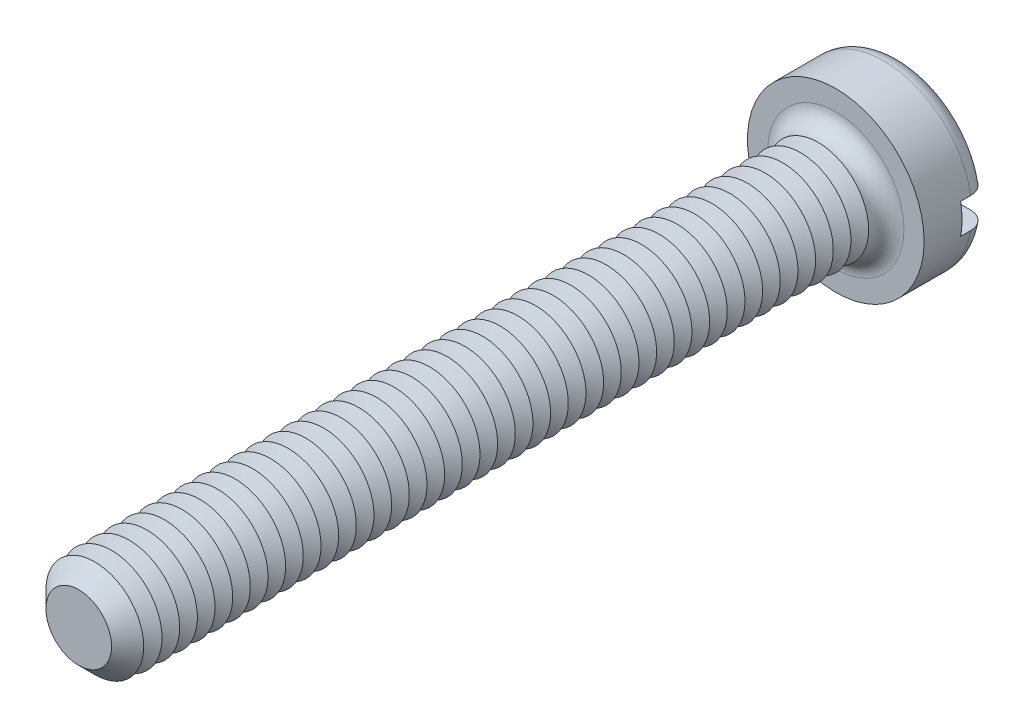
ISO-10303-21;
HEADER;
FILE_DESCRIPTION(('STEP AP214'),'2;1');
FILE_NAME('part.step','',(''),(''),'','','');
FILE_SCHEMA(('AUTOMOTIVE_DESIGN { 1 0 10303 214 1 1 1 1 }'));
ENDSEC;
DATA;
#1=APPLICATION_CONTEXT('core data for automotive mechanical design processes');
#2=APPLICATION_PROTOCOL_DEFINITION('international standard','automotive_design',2000,#1);
#3=PRODUCT_CONTEXT('',#1,'mechanical');
#4=PRODUCT('Part','Part','',(#3));
#5=PRODUCT_RELATED_PRODUCT_CATEGORY('part','',(#4));
#6=PRODUCT_DEFINITION_FORMATION('','',#4);
#7=PRODUCT_DEFINITION_CONTEXT('part definition',#1,'design');
#8=PRODUCT_DEFINITION('design','',#6,#7);
#9=PRODUCT_DEFINITION_SHAPE('','',#8);
#10=(LENGTH_UNIT() NAMED_UNIT(*) SI_UNIT(.MILLI.,.METRE.));
#11=(NAMED_UNIT(*) PLANE_ANGLE_UNIT() SI_UNIT($,.RADIAN.));
#12=(NAMED_UNIT(*) SI_UNIT($,.STERADIAN.) SOLID_ANGLE_UNIT());
#13=UNCERTAINTY_MEASURE_WITH_UNIT(LENGTH_MEASURE(1.E-05),#10,'distance_accuracy_value','');
#14=(GEOMETRIC_REPRESENTATION_CONTEXT(3) GLOBAL_UNCERTAINTY_ASSIGNED_CONTEXT((#13)) GLOBAL_UNIT_ASSIGNED_CONTEXT((#10,
#11,#12)) REPRESENTATION_CONTEXT('',''));
#15=CARTESIAN_POINT('',(0.,0.,0.));
#16=DIRECTION('',(0.,0.,1.));
#17=DIRECTION('',(1.,0.,0.));
#18=AXIS2_PLACEMENT_3D('',#15,#16,#17);
#19=CARTESIAN_POINT('',(0.,0.,-2.6));
#20=DIRECTION('',(0.,0.,1.));
#21=DIRECTION('',(1.,0.,0.));
#22=AXIS2_PLACEMENT_3D('',#19,#20,#21);
#23=PLANE('',#22);
#24=CARTESIAN_POINT('',(0.,0.,-2.6));
#25=DIRECTION('',(0.,0.,1.));
#26=DIRECTION('',(1.,0.,0.));
#27=AXIS2_PLACEMENT_3D('',#24,#25,#26);
#28=CIRCLE('',#27,2.8);
#29=CARTESIAN_POINT('',(-2.73495886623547,0.6,-2.6));
#30=VERTEX_POINT('',#29);
#31=CARTESIAN_POINT('',(2.73495886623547,0.6,-2.6));
#32=VERTEX_POINT('',#31);
#33=EDGE_CURVE('E116',#30,#32,#28,.F.);
#34=ORIENTED_EDGE('',*,*,#33,.T.);
#35=DIRECTION('',(1.,0.,0.));
#36=VECTOR('',#35,1.);
#37=CARTESIAN_POINT('',(-3.5,0.600000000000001,-2.6));
#38=LINE('',#37,#36);
#39=EDGE_CURVE('E111',#30,#32,#38,.T.);
#40=ORIENTED_EDGE('',*,*,#39,.F.);
#41=EDGE_LOOP('',(#34,#40));
#42=FACE_BOUND('',#41,.T.);
#43=ADVANCED_FACE('F39',(#42),#23,.F.);
#44=CARTESIAN_POINT('',(0.,0.,-1.9));
#45=DIRECTION('',(0.,0.,1.));
#46=DIRECTION('',(1.,0.,0.));
#47=AXIS2_PLACEMENT_3D('',#44,#45,#46);
#48=TOROIDAL_SURFACE('',#47,2.8,0.7);
#49=CARTESIAN_POINT('',(-3.24550494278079,0.600000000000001,-2.38938679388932));
#50=CARTESIAN_POINT('',(-3.21724139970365,0.600000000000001,-2.41780774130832));
#51=CARTESIAN_POINT('',(-3.18652103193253,0.600000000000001,-2.44383169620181));
#52=CARTESIAN_POINT('',(-3.12110229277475,0.600000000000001,-2.49034599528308));
#53=CARTESIAN_POINT('',(-3.08639834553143,0.6,-2.51082844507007));
#54=CARTESIAN_POINT('',(-3.01410013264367,0.6,-2.54568075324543));
#55=CARTESIAN_POINT('',(-2.97650963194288,0.6,-2.56005841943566));
#56=CARTESIAN_POINT('',(-2.89948250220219,0.6,-2.58239238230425));
#57=CARTESIAN_POINT('',(-2.86004633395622,0.6,-2.59035027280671));
#58=CARTESIAN_POINT('',(-2.77983715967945,0.6,-2.5997577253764));
#59=CARTESIAN_POINT('',(-2.73905311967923,0.6,-2.60111317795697));
#60=CARTESIAN_POINT('',(-2.65781876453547,0.6,-2.59706866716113));
#61=CARTESIAN_POINT('',(-2.61736849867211,0.6,-2.59166772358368));
#62=CARTESIAN_POINT('',(-2.53729983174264,0.6,-2.57414594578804));
#63=CARTESIAN_POINT('',(-2.49770360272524,0.6,-2.56192363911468));
#64=CARTESIAN_POINT('',(-2.421111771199,0.6,-2.5310238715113));
#65=CARTESIAN_POINT('',(-2.38411632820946,0.6,-2.51234601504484));
#66=CARTESIAN_POINT('',(-2.31371213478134,0.6,-2.46896762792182));
#67=CARTESIAN_POINT('',(-2.28031240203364,0.6,-2.44425244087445));
#68=CARTESIAN_POINT('',(-2.21823311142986,0.6,-2.38946667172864));
#69=CARTESIAN_POINT('',(-2.18955321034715,0.6,-2.35939647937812));
#70=CARTESIAN_POINT('',(-2.13836074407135,0.6,-2.29532787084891));
#71=CARTESIAN_POINT('',(-2.11574147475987,0.6,-2.26141482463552));
#72=CARTESIAN_POINT('',(-2.07677080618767,0.6,-2.19015935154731));
#73=CARTESIAN_POINT('',(-2.06041784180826,0.6,-2.15281778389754));
#74=CARTESIAN_POINT('',(-2.03508596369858,0.6,-2.07723332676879));
#75=CARTESIAN_POINT('',(-2.02585871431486,0.6,-2.03907365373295));
#76=CARTESIAN_POINT('',(-2.01416722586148,0.6,-1.96173417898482));
#77=CARTESIAN_POINT('',(-2.01170151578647,0.6,-1.92255460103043));
#78=CARTESIAN_POINT('',(-2.01359934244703,0.6,-1.84555709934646));
#79=CARTESIAN_POINT('',(-2.01775787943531,0.6,-1.80773393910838));
#80=CARTESIAN_POINT('',(-2.03236373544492,0.6,-1.73332511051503));
#81=CARTESIAN_POINT('',(-2.04281097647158,0.6,-1.69673942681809));
#82=CARTESIAN_POINT('',(-2.06962963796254,0.6,-1.62577336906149));
#83=CARTESIAN_POINT('',(-2.08600685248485,0.6,-1.59139519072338));
#84=CARTESIAN_POINT('',(-2.12413495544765,0.6,-1.52576356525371));
#85=CARTESIAN_POINT('',(-2.14588657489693,0.6,-1.49451054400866));
#86=CARTESIAN_POINT('',(-2.19483541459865,0.6,-1.43498643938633));
#87=CARTESIAN_POINT('',(-2.22217844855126,0.6,-1.40683532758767));
#88=CARTESIAN_POINT('',(-2.28105616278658,0.6,-1.35532544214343));
#89=CARTESIAN_POINT('',(-2.3125916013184,0.6,-1.33196753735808));
#90=CARTESIAN_POINT('',(-2.38018779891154,0.6,-1.28984356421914));
#91=CARTESIAN_POINT('',(-2.41637068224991,0.6,-1.27127330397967));
#92=CARTESIAN_POINT('',(-2.49129688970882,0.6,-1.24032971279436));
#93=CARTESIAN_POINT('',(-2.53004053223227,0.6,-1.22795715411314));
#94=CARTESIAN_POINT('',(-2.6098393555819,0.6,-1.2095515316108));
#95=CARTESIAN_POINT('',(-2.65092550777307,0.6,-1.20365237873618));
#96=CARTESIAN_POINT('',(-2.7335069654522,0.6,-1.1988380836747));
#97=CARTESIAN_POINT('',(-2.7750022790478,0.6,-1.19992308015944));
#98=CARTESIAN_POINT('',(-2.85718851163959,0.6,-1.20909046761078));
#99=CARTESIAN_POINT('',(-2.8978799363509,0.6,-1.21716830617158));
#100=CARTESIAN_POINT('',(-2.97729176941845,0.6,-1.24014327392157));
#101=CARTESIAN_POINT('',(-3.01601231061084,0.6,-1.25503994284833));
#102=CARTESIAN_POINT('',(-3.08976822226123,0.6,-1.29101066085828));
#103=CARTESIAN_POINT('',(-3.12484927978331,0.600000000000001,-1.31199098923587));
#104=CARTESIAN_POINT('',(-3.19090022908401,0.600000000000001,-1.35965144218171));
#105=CARTESIAN_POINT('',(-3.22187053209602,0.600000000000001,-1.38633099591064));
#106=CARTESIAN_POINT('',(-3.2781946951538,0.600000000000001,-1.44408564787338));
#107=CARTESIAN_POINT('',(-3.3036441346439,0.600000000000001,-1.47506754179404));
#108=CARTESIAN_POINT('',(-3.34887649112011,0.600000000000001,-1.54092398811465));
#109=CARTESIAN_POINT('',(-3.36865993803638,0.600000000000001,-1.57579817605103));
#110=CARTESIAN_POINT('',(-3.40166738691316,0.600000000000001,-1.64783067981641));
#111=CARTESIAN_POINT('',(-3.41499360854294,0.600000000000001,-1.68494217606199));
#112=CARTESIAN_POINT('',(-3.43515375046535,0.600000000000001,-1.76088675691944));
#113=CARTESIAN_POINT('',(-3.44198836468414,0.600000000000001,-1.79971965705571));
#114=CARTESIAN_POINT('',(-3.44891916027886,0.600000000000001,-1.87757893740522));
#115=CARTESIAN_POINT('',(-3.44908375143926,0.600000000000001,-1.91659924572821));
#116=CARTESIAN_POINT('',(-3.44284111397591,0.600000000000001,-1.99412088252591));
#117=CARTESIAN_POINT('',(-3.43643236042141,0.600000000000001,-2.03262208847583));
#118=CARTESIAN_POINT('',(-3.41725803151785,0.600000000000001,-2.10792315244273));
#119=CARTESIAN_POINT('',(-3.40450469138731,0.600000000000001,-2.14472613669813));
#120=CARTESIAN_POINT('',(-3.3730385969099,0.600000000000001,-2.21565060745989));
#121=CARTESIAN_POINT('',(-3.35433321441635,0.600000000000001,-2.24977534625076));
#122=CARTESIAN_POINT('',(-3.3201892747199,0.600000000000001,-2.30136364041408));
#123=CARTESIAN_POINT('',(-3.30647805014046,0.600000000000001,-2.31999402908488));
#124=CARTESIAN_POINT('',(-3.27728518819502,0.600000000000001,-2.35581090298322));
#125=CARTESIAN_POINT('',(-3.26180356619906,0.600000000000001,-2.37299740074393));
#126=CARTESIAN_POINT('',(-3.24550494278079,0.600000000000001,-2.38938679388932));
#127=B_SPLINE_CURVE_WITH_KNOTS('',3,(#49,#50,#51,#52,#53,#54,#55,#56,#57,#58,#59,#60,#61,#62,
#63,#64,#65,#66,#67,#68,#69,#70,#71,#72,#73,#74,#75,#76,#77,#78,#79,#80,#81,#82,#83,#84,#85,#86,
#87,#88,#89,#90,#91,#92,#93,#94,#95,#96,#97,#98,#99,#100,#101,#102,#103,#104,#105,#106,#107,
#108,#109,#110,#111,#112,#113,#114,#115,#116,#117,#118,#119,#120,#121,#122,#123,#124,#125,#126),
.UNSPECIFIED.,.T.,.F.,(4,2,2,2,2,2,2,2,2,2,2,2,2,2,2,2,2,2,2,2,2,2,2,2,2,2,2,2,2,2,2,2,2,2,2,2,
2,2,4),(0.,0.120160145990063,0.240490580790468,0.36066665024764,0.480812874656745,
0.602666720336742,0.724538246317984,0.848272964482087,0.972015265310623,1.09606100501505,
1.2200977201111,1.34178071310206,1.46343329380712,1.58062647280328,1.6977941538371,
1.81140573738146,1.92501591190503,2.03873739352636,2.15247435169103,2.26967910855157,
2.38690509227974,2.50835551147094,2.62982106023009,2.75375450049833,2.87769040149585,
3.00154567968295,3.12539259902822,3.24742469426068,3.36944457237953,3.48914477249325,
3.60883377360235,3.72656056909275,3.84427477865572,3.96078136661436,4.07731498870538,
4.19362474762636,4.3097910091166,4.37908387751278,4.44837614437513),.UNSPECIFIED.);
#128=CARTESIAN_POINT('',(-3.44818792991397,0.600000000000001,-1.8999999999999));
#129=VERTEX_POINT('',#128);
#130=EDGE_CURVE('E513',#129,#30,#127,.T.);
#131=ORIENTED_EDGE('',*,*,#130,.F.);
#132=CARTESIAN_POINT('',(0.,0.,-1.9));
#133=DIRECTION('',(0.,0.,1.));
#134=DIRECTION('',(1.,0.,0.));
#135=AXIS2_PLACEMENT_3D('',#132,#133,#134);
#136=CIRCLE('',#135,3.5);
#137=CARTESIAN_POINT('',(3.44818792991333,0.6,-1.9));
#138=VERTEX_POINT('',#137);
#139=EDGE_CURVE('E125',#138,#129,#136,.T.);
#140=ORIENTED_EDGE('',*,*,#139,.F.);
#141=CARTESIAN_POINT('',(2.1414268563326,0.6,-2.29762171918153));
#142=CARTESIAN_POINT('',(2.16505443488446,0.6,-2.33058245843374));
#143=CARTESIAN_POINT('',(2.19155609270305,0.6,-2.36152717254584));
#144=CARTESIAN_POINT('',(2.24942944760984,0.6,-2.41852964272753));
#145=CARTESIAN_POINT('',(2.28080921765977,0.6,-2.44457913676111));
#146=CARTESIAN_POINT('',(2.34741203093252,0.6,-2.49105381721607));
#147=CARTESIAN_POINT('',(2.38262862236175,0.6,-2.51148824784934));
#148=CARTESIAN_POINT('',(2.45593176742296,0.6,-2.54626881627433));
#149=CARTESIAN_POINT('',(2.49401741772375,0.6,-2.56061686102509));
#150=CARTESIAN_POINT('',(2.57272605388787,0.6,-2.58306429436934));
#151=CARTESIAN_POINT('',(2.6133821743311,0.6,-2.59104769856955));
#152=CARTESIAN_POINT('',(2.6954618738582,0.6,-2.60009608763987));
#153=CARTESIAN_POINT('',(2.73688552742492,0.6,-2.60116039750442));
#154=CARTESIAN_POINT('',(2.81941950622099,0.6,-2.5962925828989));
#155=CARTESIAN_POINT('',(2.86052888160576,0.6,-2.59034422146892));
#156=CARTESIAN_POINT('',(2.94113709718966,0.6,-2.57153687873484));
#157=CARTESIAN_POINT('',(2.98063603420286,0.6,-2.55867831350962));
#158=CARTESIAN_POINT('',(3.05633735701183,0.6,-2.52657771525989));
#159=CARTESIAN_POINT('',(3.09257627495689,0.6,-2.50742188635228));
#160=CARTESIAN_POINT('',(3.16123898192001,0.6,-2.46318606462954));
#161=CARTESIAN_POINT('',(3.19366316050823,0.6,-2.4381066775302));
#162=CARTESIAN_POINT('',(3.25312278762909,0.6,-2.38324481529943));
#163=CARTESIAN_POINT('',(3.28024842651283,0.6,-2.35356008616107));
#164=CARTESIAN_POINT('',(3.32902587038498,0.6,-2.28998971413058));
#165=CARTESIAN_POINT('',(3.35067820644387,0.6,-2.25610447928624));
#166=CARTESIAN_POINT('',(3.38751207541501,0.6,-2.18572286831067));
#167=CARTESIAN_POINT('',(3.40279804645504,0.6,-2.14928112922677));
#168=CARTESIAN_POINT('',(3.42695590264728,0.6,-2.07433042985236));
#169=CARTESIAN_POINT('',(3.43582824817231,0.6,-2.03582161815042));
#170=CARTESIAN_POINT('',(3.44682113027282,0.6,-1.95829536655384));
#171=CARTESIAN_POINT('',(3.44901648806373,0.6,-1.91928851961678));
#172=CARTESIAN_POINT('',(3.44680085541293,0.6,-1.84146366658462));
#173=CARTESIAN_POINT('',(3.44239008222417,0.6,-1.80264565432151));
#174=CARTESIAN_POINT('',(3.42712544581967,0.6,-1.72644634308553));
#175=CARTESIAN_POINT('',(3.41629508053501,0.6,-1.6890603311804));
#176=CARTESIAN_POINT('',(3.38853757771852,0.6,-1.61662604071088));
#177=CARTESIAN_POINT('',(3.37161039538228,0.6,-1.58157777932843));
#178=CARTESIAN_POINT('',(3.33207798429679,0.6,-1.51464178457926));
#179=CARTESIAN_POINT('',(3.30944854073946,0.6,-1.48276835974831));
#180=CARTESIAN_POINT('',(3.2592165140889,0.6,-1.42321861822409));
#181=CARTESIAN_POINT('',(3.23161370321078,0.6,-1.3955424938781));
#182=CARTESIAN_POINT('',(3.17188519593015,0.6,-1.34481834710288));
#183=CARTESIAN_POINT('',(3.13971065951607,0.6,-1.32182785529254));
#184=CARTESIAN_POINT('',(3.07201123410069,0.6,-1.28147003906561));
#185=CARTESIAN_POINT('',(3.03648608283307,0.6,-1.26410315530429));
#186=CARTESIAN_POINT('',(2.962449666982,0.6,-1.2351645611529));
#187=CARTESIAN_POINT('',(2.92389781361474,0.6,-1.22369671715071));
#188=CARTESIAN_POINT('',(2.84543273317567,0.6,-1.20726565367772));
#189=CARTESIAN_POINT('',(2.80551936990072,0.6,-1.20230308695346));
#190=CARTESIAN_POINT('',(2.72467191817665,0.6,-1.1989357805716));
#191=CARTESIAN_POINT('',(2.68373266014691,0.6,-1.20065484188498));
#192=CARTESIAN_POINT('',(2.60270222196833,0.6,-1.21084560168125));
#193=CARTESIAN_POINT('',(2.56261112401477,0.6,-1.21931795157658));
#194=CARTESIAN_POINT('',(2.48385954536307,0.6,-1.24292934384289));
#195=CARTESIAN_POINT('',(2.44522508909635,0.6,-1.25815531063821));
#196=CARTESIAN_POINT('',(2.37106165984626,0.6,-1.29488663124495));
#197=CARTESIAN_POINT('',(2.33553282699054,0.6,-1.31639226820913));
#198=CARTESIAN_POINT('',(2.2686996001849,0.6,-1.36507949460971));
#199=CARTESIAN_POINT('',(2.23738745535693,0.6,-1.39225042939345));
#200=CARTESIAN_POINT('',(2.17990424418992,0.6,-1.45157941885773));
#201=CARTESIAN_POINT('',(2.15373259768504,0.6,-1.48373691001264));
#202=CARTESIAN_POINT('',(2.10799355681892,0.6,-1.551327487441));
#203=CARTESIAN_POINT('',(2.08828258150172,0.6,-1.58666329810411));
#204=CARTESIAN_POINT('',(2.05534440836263,0.6,-1.66023600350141));
#205=CARTESIAN_POINT('',(2.042115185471,0.6,-1.6984719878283));
#206=CARTESIAN_POINT('',(2.02303126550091,0.6,-1.77519783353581));
#207=CARTESIAN_POINT('',(2.01691541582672,0.6,-1.8136228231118));
#208=CARTESIAN_POINT('',(2.01140375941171,0.6,-1.89096056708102));
#209=CARTESIAN_POINT('',(2.01200856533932,0.6,-1.92987336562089));
#210=CARTESIAN_POINT('',(2.01981617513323,0.6,-2.006065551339));
#211=CARTESIAN_POINT('',(2.02685835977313,0.6,-2.04336165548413));
#212=CARTESIAN_POINT('',(2.0470502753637,0.6,-2.1162250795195));
#213=CARTESIAN_POINT('',(2.06019252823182,0.6,-2.15179445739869));
#214=CARTESIAN_POINT('',(2.08525738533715,0.6,-2.20558874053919));
#215=CARTESIAN_POINT('',(2.09529161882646,0.6,-2.22471751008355));
#216=CARTESIAN_POINT('',(2.11708813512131,0.6,-2.26196179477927));
#217=CARTESIAN_POINT('',(2.12885034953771,0.6,-2.28007734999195));
#218=CARTESIAN_POINT('',(2.1414268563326,0.6,-2.29762171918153));
#219=B_SPLINE_CURVE_WITH_KNOTS('',3,(#141,#142,#143,#144,#145,#146,#147,#148,#149,#150,#151,
#152,#153,#154,#155,#156,#157,#158,#159,#160,#161,#162,#163,#164,#165,#166,#167,#168,#169,#170,
#171,#172,#173,#174,#175,#176,#177,#178,#179,#180,#181,#182,#183,#184,#185,#186,#187,#188,#189,
#190,#191,#192,#193,#194,#195,#196,#197,#198,#199,#200,#201,#202,#203,#204,#205,#206,#207,#208,
#209,#210,#211,#212,#213,#214,#215,#216,#217,#218),.UNSPECIFIED.,.T.,.F.,(4,2,2,2,2,2,2,2,2,2,2,
2,2,2,2,2,2,2,2,2,2,2,2,2,2,2,2,2,2,2,2,2,2,2,2,2,2,2,4),(0.,0.121582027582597,
0.243367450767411,0.364951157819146,0.486496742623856,0.610209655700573,0.733934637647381,
0.857946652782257,0.981951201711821,1.1043243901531,1.22668507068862,1.34673532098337,
1.46677391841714,1.58475736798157,1.70273234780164,1.81938035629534,1.93602452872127,
2.05224435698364,2.168465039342,2.28518782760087,2.40191596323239,2.52000081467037,
2.63809491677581,2.75820270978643,2.87832255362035,3.00067856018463,3.1230463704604,
3.24703703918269,3.37103329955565,3.49479843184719,3.6185495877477,3.73932715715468,
3.86006696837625,3.9762182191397,4.09238005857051,4.2057203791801,4.31892212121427,
4.38364046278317,4.44835624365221),.UNSPECIFIED.);
#220=EDGE_CURVE('E515',#32,#138,#219,.T.);
#221=ORIENTED_EDGE('',*,*,#220,.F.);
#222=ORIENTED_EDGE('',*,*,#33,.F.);
#223=EDGE_LOOP('',(#131,#140,#221,#222));
#224=FACE_BOUND('',#223,.T.);
#225=ADVANCED_FACE('F497',(#224),#48,.T.);
#226=CARTESIAN_POINT('',(0.,0.,-2.6));
#227=DIRECTION('',(0.,0.,1.));
#228=DIRECTION('',(1.,0.,0.));
#229=AXIS2_PLACEMENT_3D('',#226,#227,#228);
#230=CYLINDRICAL_SURFACE('',#229,3.5);
#231=DIRECTION('',(0.,0.,1.));
#232=VECTOR('',#231,1.);
#233=CARTESIAN_POINT('',(3.44818792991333,0.6,-2.6));
#234=LINE('',#233,#232);
#235=CARTESIAN_POINT('',(3.44818792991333,0.6,-1.5));
#236=VERTEX_POINT('',#235);
#237=EDGE_CURVE('E529',#138,#236,#234,.T.);
#238=ORIENTED_EDGE('',*,*,#237,.F.);
#239=ORIENTED_EDGE('',*,*,#139,.T.);
#240=DIRECTION('',(0.,0.,1.));
#241=VECTOR('',#240,1.);
#242=CARTESIAN_POINT('',(-3.44818792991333,0.600000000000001,-2.6));
#243=LINE('',#242,#241);
#244=CARTESIAN_POINT('',(-3.44818792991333,0.600000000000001,-1.5));
#245=VERTEX_POINT('',#244);
#246=EDGE_CURVE('E63',#245,#129,#243,.F.);
#247=ORIENTED_EDGE('',*,*,#246,.F.);
#248=CARTESIAN_POINT('',(0.,0.,-1.5));
#249=DIRECTION('',(0.,0.,-1.));
#250=DIRECTION('',(-1.,0.,0.));
#251=AXIS2_PLACEMENT_3D('',#248,#249,#250);
#252=CIRCLE('',#251,3.5);
#253=CARTESIAN_POINT('',(-3.44818792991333,-0.599999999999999,-1.5));
#254=VERTEX_POINT('',#253);
#255=EDGE_CURVE('E43',#245,#254,#252,.F.);
#256=ORIENTED_EDGE('',*,*,#255,.T.);
#257=DIRECTION('',(0.,0.,1.));
#258=VECTOR('',#257,1.);
#259=CARTESIAN_POINT('',(-3.44818792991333,-0.599999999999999,-2.6));
#260=LINE('',#259,#258);
#261=CARTESIAN_POINT('',(-3.44818792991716,-0.599999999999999,-1.90000000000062));
#262=VERTEX_POINT('',#261);
#263=EDGE_CURVE('E526',#262,#254,#260,.T.);
#264=ORIENTED_EDGE('',*,*,#263,.F.);
#265=CARTESIAN_POINT('',(3.44818792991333,-0.6,-1.9));
#266=VERTEX_POINT('',#265);
#267=EDGE_CURVE('E127',#262,#266,#136,.T.);
#268=ORIENTED_EDGE('',*,*,#267,.T.);
#269=DIRECTION('',(0.,0.,1.));
#270=VECTOR('',#269,1.);
#271=CARTESIAN_POINT('',(3.44818792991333,-0.6,-2.6));
#272=LINE('',#271,#270);
#273=CARTESIAN_POINT('',(3.44818792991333,-0.6,-1.5));
#274=VERTEX_POINT('',#273);
#275=EDGE_CURVE('E55',#274,#266,#272,.F.);
#276=ORIENTED_EDGE('',*,*,#275,.F.);
#277=EDGE_CURVE('E11',#274,#236,#252,.F.);
#278=ORIENTED_EDGE('',*,*,#277,.T.);
#279=EDGE_LOOP('',(#238,#239,#247,#256,#264,#268,#276,#278));
#280=FACE_BOUND('',#279,.T.);
#281=CARTESIAN_POINT('',(0.,0.,0.));
#282=DIRECTION('',(0.,0.,1.));
#283=DIRECTION('',(1.,0.,0.));
#284=AXIS2_PLACEMENT_3D('',#281,#282,#283);
#285=CIRCLE('',#284,3.5);
#286=CARTESIAN_POINT('',(3.5,0.,0.));
#287=VERTEX_POINT('',#286);
#288=EDGE_CURVE('E532',#287,#287,#285,.T.);
#289=ORIENTED_EDGE('',*,*,#288,.F.);
#290=EDGE_LOOP('',(#289));
#291=FACE_BOUND('',#290,.T.);
#292=ADVANCED_FACE('F493',(#280,#291),#230,.T.);
#293=CARTESIAN_POINT('',(2.73495886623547,-0.6,-2.6));
#294=VERTEX_POINT('',#293);
#295=CARTESIAN_POINT('',(-2.73495886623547,-0.6,-2.6));
#296=VERTEX_POINT('',#295);
#297=EDGE_CURVE('E109',#294,#296,#28,.F.);
#298=ORIENTED_EDGE('',*,*,#297,.T.);
#299=DIRECTION('',(-1.,0.,0.));
#300=VECTOR('',#299,1.);
#301=CARTESIAN_POINT('',(-3.5,-0.599999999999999,-2.6));
#302=LINE('',#301,#300);
#303=EDGE_CURVE('E96',#294,#296,#302,.T.);
#304=ORIENTED_EDGE('',*,*,#303,.F.);
#305=EDGE_LOOP('',(#298,#304));
#306=FACE_BOUND('',#305,.T.);
#307=ADVANCED_FACE('F108',(#306),#23,.F.);
#308=CARTESIAN_POINT('',(0.,0.,0.));
#309=DIRECTION('',(0.,0.,1.));
#310=DIRECTION('',(1.,0.,0.));
#311=AXIS2_PLACEMENT_3D('',#308,#309,#310);
#312=PLANE('',#311);
#313=CARTESIAN_POINT('',(0.,0.,0.));
#314=DIRECTION('',(0.,0.,1.));
#315=DIRECTION('',(1.,0.,0.));
#316=AXIS2_PLACEMENT_3D('',#313,#314,#315);
#317=CIRCLE('',#316,2.7);
#318=CARTESIAN_POINT('',(2.7,0.,0.));
#319=VERTEX_POINT('',#318);
#320=EDGE_CURVE('E115',#319,#319,#317,.F.);
#321=ORIENTED_EDGE('',*,*,#320,.T.);
#322=EDGE_LOOP('',(#321));
#323=FACE_BOUND('',#322,.T.);
#324=ORIENTED_EDGE('',*,*,#288,.T.);
#325=EDGE_LOOP('',(#324));
#326=FACE_BOUND('',#325,.T.);
#327=ADVANCED_FACE('F492',(#323,#326),#312,.T.);
#328=CARTESIAN_POINT('',(-3.24550494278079,-0.599999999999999,-2.38938679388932));
#329=CARTESIAN_POINT('',(-3.27309693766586,-0.599999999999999,-2.36163611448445));
#330=CARTESIAN_POINT('',(-3.29838741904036,-0.599999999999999,-2.3315608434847));
#331=CARTESIAN_POINT('',(-3.34359429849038,-0.599999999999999,-2.26757659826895));
#332=CARTESIAN_POINT('',(-3.36350518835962,-0.599999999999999,-2.23366374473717));
#333=CARTESIAN_POINT('',(-3.39733065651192,-0.599999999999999,-2.16296274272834));
#334=CARTESIAN_POINT('',(-3.4112451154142,-0.599999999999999,-2.12617453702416));
#335=CARTESIAN_POINT('',(-3.43264462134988,-0.599999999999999,-2.05078178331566));
#336=CARTESIAN_POINT('',(-3.44013114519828,-0.599999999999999,-2.01217765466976));
#337=CARTESIAN_POINT('',(-3.44841975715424,-0.599999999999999,-1.9345391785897));
#338=CARTESIAN_POINT('',(-3.44926944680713,-0.599999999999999,-1.89550990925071));
#339=CARTESIAN_POINT('',(-3.44438358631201,-0.599999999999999,-1.81786552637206));
#340=CARTESIAN_POINT('',(-3.43864801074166,-0.599999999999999,-1.77925041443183));
#341=CARTESIAN_POINT('',(-3.42079221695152,-0.599999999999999,-1.70364264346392));
#342=CARTESIAN_POINT('',(-3.40869011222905,-0.599999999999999,-1.66664570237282));
#343=CARTESIAN_POINT('',(-3.37847692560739,-0.599999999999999,-1.59519424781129));
#344=CARTESIAN_POINT('',(-3.3603657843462,-0.599999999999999,-1.56073975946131));
#345=CARTESIAN_POINT('',(-3.31856549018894,-0.599999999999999,-1.4951524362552));
#346=CARTESIAN_POINT('',(-3.29484830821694,-0.599999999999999,-1.46403747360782));
#347=CARTESIAN_POINT('',(-3.24258489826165,-0.599999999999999,-1.40617131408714));
#348=CARTESIAN_POINT('',(-3.21403843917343,-0.599999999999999,-1.37942032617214));
#349=CARTESIAN_POINT('',(-3.15256084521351,-0.599999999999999,-1.33067963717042));
#350=CARTESIAN_POINT('',(-3.11958015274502,-0.599999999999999,-1.30875246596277));
#351=CARTESIAN_POINT('',(-3.0504559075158,-0.599999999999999,-1.27063718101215));
#352=CARTESIAN_POINT('',(-3.01431209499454,-0.6,-1.25444953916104));
#353=CARTESIAN_POINT('',(-2.93921710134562,-0.6,-1.22796796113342));
#354=CARTESIAN_POINT('',(-2.90022796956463,-0.6,-1.217781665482));
#355=CARTESIAN_POINT('',(-2.82110512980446,-0.6,-1.20396915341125));
#356=CARTESIAN_POINT('',(-2.7809713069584,-0.6,-1.2003435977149));
#357=CARTESIAN_POINT('',(-2.69990924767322,-0.6,-1.19969717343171));
#358=CARTESIAN_POINT('',(-2.65898001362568,-0.6,-1.20279937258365));
#359=CARTESIAN_POINT('',(-2.57819986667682,-0.6,-1.21574287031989));
#360=CARTESIAN_POINT('',(-2.53834905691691,-0.6,-1.22558481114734));
#361=CARTESIAN_POINT('',(-2.46035232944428,-0.6,-1.25189361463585));
#362=CARTESIAN_POINT('',(-2.42223314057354,-0.6,-1.2684398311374));
#363=CARTESIAN_POINT('',(-2.34932316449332,-0.6,-1.30771928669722));
#364=CARTESIAN_POINT('',(-2.31453248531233,-0.6,-1.33045272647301));
#365=CARTESIAN_POINT('',(-2.24945577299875,-0.6,-1.38141543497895));
#366=CARTESIAN_POINT('',(-2.21915255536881,-0.6,-1.40962272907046));
#367=CARTESIAN_POINT('',(-2.16386461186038,-0.6,-1.47084552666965));
#368=CARTESIAN_POINT('',(-2.13887916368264,-0.6,-1.50386037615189));
#369=CARTESIAN_POINT('',(-2.09568071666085,-0.6,-1.57285917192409));
#370=CARTESIAN_POINT('',(-2.07730739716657,-0.6,-1.60874263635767));
#371=CARTESIAN_POINT('',(-2.04712019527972,-0.6,-1.68316975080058));
#372=CARTESIAN_POINT('',(-2.03530452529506,-0.6,-1.72171267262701));
#373=CARTESIAN_POINT('',(-2.01901751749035,-0.6,-1.79878952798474));
#374=CARTESIAN_POINT('',(-2.01428434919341,-0.6,-1.8372682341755));
#375=CARTESIAN_POINT('',(-2.01150652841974,-0.6,-1.91446369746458));
#376=CARTESIAN_POINT('',(-2.01346084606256,-0.6,-1.95318041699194));
#377=CARTESIAN_POINT('',(-2.02386268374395,-0.6,-2.0288619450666));
#378=CARTESIAN_POINT('',(-2.03216724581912,-0.6,-2.06584654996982));
#379=CARTESIAN_POINT('',(-2.05479337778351,-0.6,-2.13792373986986));
#380=CARTESIAN_POINT('',(-2.06911522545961,-0.6,-2.1730162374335));
#381=CARTESIAN_POINT('',(-2.10349906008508,-0.6,-2.24081034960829));
#382=CARTESIAN_POINT('',(-2.12363007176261,-0.6,-2.27347689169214));
#383=CARTESIAN_POINT('',(-2.16891308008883,-0.6,-2.33511902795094));
#384=CARTESIAN_POINT('',(-2.19406590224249,-0.6,-2.36409401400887));
#385=CARTESIAN_POINT('',(-2.24962389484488,-0.6,-2.41861972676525));
#386=CARTESIAN_POINT('',(-2.28018314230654,-0.6,-2.44401345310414));
#387=CARTESIAN_POINT('',(-2.34501720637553,-0.6,-2.48950558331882));
#388=CARTESIAN_POINT('',(-2.37929266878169,-0.6,-2.50960306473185));
#389=CARTESIAN_POINT('',(-2.45179417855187,-0.6,-2.54458276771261));
#390=CARTESIAN_POINT('',(-2.49011248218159,-0.6,-2.55927401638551));
#391=CARTESIAN_POINT('',(-2.56865227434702,-0.6,-2.58211133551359));
#392=CARTESIAN_POINT('',(-2.60887386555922,-0.6,-2.59025705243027));
#393=CARTESIAN_POINT('',(-2.69064746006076,-0.6,-2.59982905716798));
#394=CARTESIAN_POINT('',(-2.73220999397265,-0.6,-2.60116580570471));
#395=CARTESIAN_POINT('',(-2.81497658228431,-0.6,-2.59679700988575));
#396=CARTESIAN_POINT('',(-2.85618055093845,-0.6,-2.59108982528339));
#397=CARTESIAN_POINT('',(-2.93677683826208,-0.6,-2.57279487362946));
#398=CARTESIAN_POINT('',(-2.97617834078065,-0.6,-2.56024753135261));
#399=CARTESIAN_POINT('',(-3.05222242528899,-0.6,-2.52860709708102));
#400=CARTESIAN_POINT('',(-3.08886850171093,-0.599999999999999,-2.50952247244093));
#401=CARTESIAN_POINT('',(-3.14562501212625,-0.599999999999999,-2.47340693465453));
#402=CARTESIAN_POINT('',(-3.16689358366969,-0.599999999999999,-2.45816337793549));
#403=CARTESIAN_POINT('',(-3.20761866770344,-0.599999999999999,-2.42542115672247));
#404=CARTESIAN_POINT('',(-3.22707520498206,-0.599999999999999,-2.40792252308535));
#405=CARTESIAN_POINT('',(-3.24550494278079,-0.599999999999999,-2.38938679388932));
#406=B_SPLINE_CURVE_WITH_KNOTS('',3,(#328,#329,#330,#331,#332,#333,#334,#335,#336,#337,#338,
#339,#340,#341,#342,#343,#344,#345,#346,#347,#348,#349,#350,#351,#352,#353,#354,#355,#356,#357,
#358,#359,#360,#361,#362,#363,#364,#365,#366,#367,#368,#369,#370,#371,#372,#373,#374,#375,#376,
#377,#378,#379,#380,#381,#382,#383,#384,#385,#386,#387,#388,#389,#390,#391,#392,#393,#394,#395,
#396,#397,#398,#399,#400,#401,#402,#403,#404,#405),.UNSPECIFIED.,.T.,.F.,(4,2,2,2,2,2,2,2,2,2,2,
2,2,2,2,2,2,2,2,2,2,2,2,2,2,2,2,2,2,2,2,2,2,2,2,2,2,2,4),(0.,0.117306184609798,
0.234732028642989,0.352160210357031,0.469561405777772,0.586119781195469,0.702678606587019,
0.818907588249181,0.935137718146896,1.05196174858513,1.1687913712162,1.2870562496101,
1.40533084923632,1.52566688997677,1.64601504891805,1.76858322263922,1.89116307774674,
2.01523830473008,2.13931755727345,2.26290863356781,2.38648291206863,2.50681878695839,
2.62712184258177,2.74285697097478,2.85857427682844,2.97176054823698,3.08495204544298,
3.19954814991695,3.31416310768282,3.43282436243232,3.55150627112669,3.67404987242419,
3.79660009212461,3.92075778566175,4.04494439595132,4.16840490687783,4.29170610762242,
4.3700604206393,4.44841366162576),.UNSPECIFIED.);
#407=EDGE_CURVE('E103',#296,#262,#406,.T.);
#408=ORIENTED_EDGE('',*,*,#407,.F.);
#409=ORIENTED_EDGE('',*,*,#297,.F.);
#410=CARTESIAN_POINT('',(2.1414268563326,-0.6,-2.29762171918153));
#411=CARTESIAN_POINT('',(2.11900044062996,-0.6,-2.26633119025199));
#412=CARTESIAN_POINT('',(2.09913154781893,-0.6,-2.23318080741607));
#413=CARTESIAN_POINT('',(2.06517900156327,-0.6,-2.16401111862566));
#414=CARTESIAN_POINT('',(2.05109968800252,-0.6,-2.12798968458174));
#415=CARTESIAN_POINT('',(2.02923593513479,-0.6,-2.05404277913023));
#416=CARTESIAN_POINT('',(2.02145692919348,-0.6,-2.01611569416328));
#417=CARTESIAN_POINT('',(2.01251710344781,-0.6,-1.93949649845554));
#418=CARTESIAN_POINT('',(2.01135461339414,-0.6,-1.90080458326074));
#419=CARTESIAN_POINT('',(2.01564803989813,-0.6,-1.82450508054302));
#420=CARTESIAN_POINT('',(2.02098305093,-0.6,-1.78689061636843));
#421=CARTESIAN_POINT('',(2.03786826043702,-0.6,-1.71308589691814));
#422=CARTESIAN_POINT('',(2.04941870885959,-0.6,-1.67689569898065));
#423=CARTESIAN_POINT('',(2.07838664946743,-0.6,-1.60676639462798));
#424=CARTESIAN_POINT('',(2.09582944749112,-0.6,-1.57283776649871));
#425=CARTESIAN_POINT('',(2.1359925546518,-0.6,-1.50826612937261));
#426=CARTESIAN_POINT('',(2.15871360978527,-0.6,-1.47762358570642));
#427=CARTESIAN_POINT('',(2.20955413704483,-0.6,-1.41943384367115));
#428=CARTESIAN_POINT('',(2.23782364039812,-0.6,-1.39201777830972));
#429=CARTESIAN_POINT('',(2.29842612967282,-0.6,-1.34212199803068));
#430=CARTESIAN_POINT('',(2.33075984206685,-0.6,-1.31964316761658));
#431=CARTESIAN_POINT('',(2.399806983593,-0.6,-1.27945238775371));
#432=CARTESIAN_POINT('',(2.43663466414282,-0.6,-1.26193653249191));
#433=CARTESIAN_POINT('',(2.51267241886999,-0.6,-1.23320660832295));
#434=CARTESIAN_POINT('',(2.55188277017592,-0.6,-1.22199327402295));
#435=CARTESIAN_POINT('',(2.63235000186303,-0.6,-1.20602688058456));
#436=CARTESIAN_POINT('',(2.673631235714,-0.6,-1.20139617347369));
#437=CARTESIAN_POINT('',(2.7563863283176,-0.6,-1.19914622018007));
#438=CARTESIAN_POINT('',(2.79786018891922,-0.6,-1.20152704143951));
#439=CARTESIAN_POINT('',(2.87971192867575,-0.6,-1.21326884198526));
#440=CARTESIAN_POINT('',(2.92009214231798,-0.6,-1.22261349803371));
#441=CARTESIAN_POINT('',(2.99866777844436,-0.6,-1.24805614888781));
#442=CARTESIAN_POINT('',(3.03686335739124,-0.6,-1.26415365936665));
#443=CARTESIAN_POINT('',(3.10934738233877,-0.6,-1.3023912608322));
#444=CARTESIAN_POINT('',(3.14368704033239,-0.6,-1.32443423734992));
#445=CARTESIAN_POINT('',(3.20808395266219,-0.6,-1.37407725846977));
#446=CARTESIAN_POINT('',(3.23814164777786,-0.6,-1.40167673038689));
#447=CARTESIAN_POINT('',(3.29251534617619,-0.6,-1.46108303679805));
#448=CARTESIAN_POINT('',(3.3169296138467,-0.6,-1.49279994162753));
#449=CARTESIAN_POINT('',(3.35998418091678,-0.6,-1.55993706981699));
#450=CARTESIAN_POINT('',(3.37862502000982,-0.6,-1.59535694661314));
#451=CARTESIAN_POINT('',(3.40930212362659,-0.6,-1.668283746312));
#452=CARTESIAN_POINT('',(3.42143897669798,-0.6,-1.70574837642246));
#453=CARTESIAN_POINT('',(3.43918305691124,-0.6,-1.78219297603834));
#454=CARTESIAN_POINT('',(3.44479069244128,-0.6,-1.82117285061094));
#455=CARTESIAN_POINT('',(3.44928173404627,-0.6,-1.89914596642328));
#456=CARTESIAN_POINT('',(3.44822835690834,-0.6,-1.93813558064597));
#457=CARTESIAN_POINT('',(3.43957811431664,-0.6,-2.0153811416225));
#458=CARTESIAN_POINT('',(3.43198139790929,-0.6,-2.05363710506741));
#459=CARTESIAN_POINT('',(3.41049386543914,-0.6,-2.12826741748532));
#460=CARTESIAN_POINT('',(3.39661362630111,-0.6,-2.16464481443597));
#461=CARTESIAN_POINT('',(3.36297924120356,-0.6,-2.23457274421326));
#462=CARTESIAN_POINT('',(3.34322499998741,-0.6,-2.26812323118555));
#463=CARTESIAN_POINT('',(3.29828706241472,-0.6,-2.33167864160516));
#464=CARTESIAN_POINT('',(3.27307040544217,-0.6,-2.36166024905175));
#465=CARTESIAN_POINT('',(3.21802069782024,-0.6,-2.41703165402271));
#466=CARTESIAN_POINT('',(3.18818738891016,-0.6,-2.44242119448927));
#467=CARTESIAN_POINT('',(3.12433871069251,-0.6,-2.48825551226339));
#468=CARTESIAN_POINT('',(3.09027338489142,-0.6,-2.50863067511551));
#469=CARTESIAN_POINT('',(3.01925175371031,-0.6,-2.54348754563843));
#470=CARTESIAN_POINT('',(2.982295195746,-0.6,-2.55796873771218));
#471=CARTESIAN_POINT('',(2.90583499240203,-0.6,-2.58090526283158));
#472=CARTESIAN_POINT('',(2.86629758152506,-0.6,-2.58924801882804));
#473=CARTESIAN_POINT('',(2.78639041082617,-0.6,-2.59930573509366));
#474=CARTESIAN_POINT('',(2.7460205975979,-0.6,-2.60102026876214));
#475=CARTESIAN_POINT('',(2.66482039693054,-0.6,-2.59779078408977));
#476=CARTESIAN_POINT('',(2.62399477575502,-0.6,-2.59272651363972));
#477=CARTESIAN_POINT('',(2.54373809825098,-0.6,-2.57588976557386));
#478=CARTESIAN_POINT('',(2.50430750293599,-0.6,-2.56411509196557));
#479=CARTESIAN_POINT('',(2.42753167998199,-0.6,-2.53401488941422));
#480=CARTESIAN_POINT('',(2.39021407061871,-0.6,-2.51561892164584));
#481=CARTESIAN_POINT('',(2.31925431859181,-0.6,-2.4727929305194));
#482=CARTESIAN_POINT('',(2.28560806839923,-0.6,-2.44836975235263));
#483=CARTESIAN_POINT('',(2.23316677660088,-0.6,-2.40295212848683));
#484=CARTESIAN_POINT('',(2.21309339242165,-0.6,-2.38341311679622));
#485=CARTESIAN_POINT('',(2.17537212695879,-0.6,-2.34211733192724));
#486=CARTESIAN_POINT('',(2.1577241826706,-0.6,-2.32036061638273));
#487=CARTESIAN_POINT('',(2.1414268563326,-0.6,-2.29762171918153));
#488=B_SPLINE_CURVE_WITH_KNOTS('',3,(#410,#411,#412,#413,#414,#415,#416,#417,#418,#419,#420,
#421,#422,#423,#424,#425,#426,#427,#428,#429,#430,#431,#432,#433,#434,#435,#436,#437,#438,#439,
#440,#441,#442,#443,#444,#445,#446,#447,#448,#449,#450,#451,#452,#453,#454,#455,#456,#457,#458,
#459,#460,#461,#462,#463,#464,#465,#466,#467,#468,#469,#470,#471,#472,#473,#474,#475,#476,#477,
#478,#479,#480,#481,#482,#483,#484,#485,#486,#487),.UNSPECIFIED.,.T.,.F.,(4,2,2,2,2,2,2,2,2,2,2,
2,2,2,2,2,2,2,2,2,2,2,2,2,2,2,2,2,2,2,2,2,2,2,2,2,2,2,4),(0.,0.115394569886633,
0.230875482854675,0.346455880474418,0.462007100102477,0.575440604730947,0.688878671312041,
0.802810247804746,0.91675793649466,1.03436780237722,1.15199872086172,1.27377854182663,
1.39557255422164,1.51960202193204,1.64363268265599,1.76737352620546,1.89110549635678,
2.01292743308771,2.13473682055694,2.25423121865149,2.37371444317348,2.49129215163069,
2.60886250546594,2.72531873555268,2.8417723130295,2.95803059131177,3.07429075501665,
3.19127301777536,3.30826182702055,3.42679321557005,3.54533497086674,3.66599996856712,
3.78667273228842,3.90951478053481,4.03239705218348,4.15662720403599,4.28071691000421,
4.36457658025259,4.44843407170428),.UNSPECIFIED.);
#489=EDGE_CURVE('E92',#266,#294,#488,.T.);
#490=ORIENTED_EDGE('',*,*,#489,.F.);
#491=ORIENTED_EDGE('',*,*,#267,.F.);
#492=EDGE_LOOP('',(#408,#409,#490,#491));
#493=FACE_BOUND('',#492,.T.);
#494=ADVANCED_FACE('F113',(#493),#48,.T.);
#495=CARTESIAN_POINT('',(0.,0.,0.699999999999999));
#496=DIRECTION('',(0.,0.,1.));
#497=DIRECTION('',(1.,0.,0.));
#498=AXIS2_PLACEMENT_3D('',#495,#496,#497);
#499=TOROIDAL_SURFACE('',#498,2.7,0.7);
#500=ORIENTED_EDGE('',*,*,#320,.F.);
#501=EDGE_LOOP('',(#500));
#502=FACE_BOUND('',#501,.T.);
#503=CARTESIAN_POINT('',(0.,0.,0.699999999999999));
#504=DIRECTION('',(0.,0.,-1.));
#505=DIRECTION('',(-1.,0.,0.));
#506=AXIS2_PLACEMENT_3D('',#503,#504,#505);
#507=CIRCLE('',#506,2.);
#508=CARTESIAN_POINT('',(-2.,0.,0.699999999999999));
#509=VERTEX_POINT('',#508);
#510=EDGE_CURVE('E538',#509,#509,#507,.T.);
#511=ORIENTED_EDGE('',*,*,#510,.T.);
#512=EDGE_LOOP('',(#511));
#513=FACE_BOUND('',#512,.T.);
#514=ADVANCED_FACE('F485',(#502,#513),#499,.F.);
#515=CARTESIAN_POINT('',(0.,0.,1.05));
#516=DIRECTION('',(0.,0.,-1.));
#517=DIRECTION('',(-1.,0.,0.));
#518=AXIS2_PLACEMENT_3D('',#515,#516,#517);
#519=CONICAL_SURFACE('',#518,1.39378221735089,1.0471975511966);
#520=ORIENTED_EDGE('',*,*,#510,.F.);
#521=EDGE_LOOP('',(#520));
#522=FACE_BOUND('',#521,.T.);
#523=CARTESIAN_POINT('',(0.,0.,1.05));
#524=DIRECTION('',(0.,0.,-1.));
#525=DIRECTION('',(-1.,0.,0.));
#526=AXIS2_PLACEMENT_3D('',#523,#524,#525);
#527=CIRCLE('',#526,1.39378221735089);
#528=CARTESIAN_POINT('',(-1.39378221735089,0.,1.05));
#529=VERTEX_POINT('',#528);
#530=EDGE_CURVE('E544',#529,#529,#527,.T.);
#531=ORIENTED_EDGE('',*,*,#530,.T.);
#532=EDGE_LOOP('',(#531));
#533=FACE_BOUND('',#532,.T.);
#534=ADVANCED_FACE('F481',(#522,#533),#519,.T.);
#535=CARTESIAN_POINT('',(0.,0.,1.4));
#536=DIRECTION('',(0.,0.,1.));
#537=DIRECTION('',(1.,0.,0.));
#538=AXIS2_PLACEMENT_3D('',#535,#536,#537);
#539=CONICAL_SURFACE('',#538,2.,1.0471975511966);
#540=ORIENTED_EDGE('',*,*,#530,.F.);
#541=EDGE_LOOP('',(#540));
#542=FACE_BOUND('',#541,.T.);
#543=CARTESIAN_POINT('',(0.,0.,1.4));
#544=DIRECTION('',(0.,0.,-1.));
#545=DIRECTION('',(-1.,0.,0.));
#546=AXIS2_PLACEMENT_3D('',#543,#544,#545);
#547=CIRCLE('',#546,2.);
#548=CARTESIAN_POINT('',(-2.,0.,1.4));
#549=VERTEX_POINT('',#548);
#550=EDGE_CURVE('E550',#549,#549,#547,.T.);
#551=ORIENTED_EDGE('',*,*,#550,.T.);
#552=EDGE_LOOP('',(#551));
#553=FACE_BOUND('',#552,.T.);
#554=ADVANCED_FACE('F477',(#542,#553),#539,.T.);
#555=CARTESIAN_POINT('',(0.,0.,1.75));
#556=DIRECTION('',(0.,0.,-1.));
#557=DIRECTION('',(-1.,0.,0.));
#558=AXIS2_PLACEMENT_3D('',#555,#556,#557);
#559=CONICAL_SURFACE('',#558,1.39378221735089,1.0471975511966);
#560=ORIENTED_EDGE('',*,*,#550,.F.);
#561=EDGE_LOOP('',(#560));
#562=FACE_BOUND('',#561,.T.);
#563=CARTESIAN_POINT('',(0.,0.,1.75));
#564=DIRECTION('',(0.,0.,-1.));
#565=DIRECTION('',(-1.,0.,0.));
#566=AXIS2_PLACEMENT_3D('',#563,#564,#565);
#567=CIRCLE('',#566,1.39378221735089);
#568=CARTESIAN_POINT('',(-1.39378221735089,0.,1.75));
#569=VERTEX_POINT('',#568);
#570=EDGE_CURVE('E553',#569,#569,#567,.T.);
#571=ORIENTED_EDGE('',*,*,#570,.T.);
#572=EDGE_LOOP('',(#571));
#573=FACE_BOUND('',#572,.T.);
#574=ADVANCED_FACE('F473',(#562,#573),#559,.T.);
#575=CARTESIAN_POINT('',(0.,0.,2.1));
#576=DIRECTION('',(0.,0.,1.));
#577=DIRECTION('',(1.,0.,0.));
#578=AXIS2_PLACEMENT_3D('',#575,#576,#577);
#579=CONICAL_SURFACE('',#578,2.,1.0471975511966);
#580=ORIENTED_EDGE('',*,*,#570,.F.);
#581=EDGE_LOOP('',(#580));
#582=FACE_BOUND('',#581,.T.);
#583=CARTESIAN_POINT('',(0.,0.,2.1));
#584=DIRECTION('',(0.,0.,-1.));
#585=DIRECTION('',(-1.,0.,0.));
#586=AXIS2_PLACEMENT_3D('',#583,#584,#585);
#587=CIRCLE('',#586,2.);
#588=CARTESIAN_POINT('',(-2.,0.,2.1));
#589=VERTEX_POINT('',#588);
#590=EDGE_CURVE('E557',#589,#589,#587,.T.);
#591=ORIENTED_EDGE('',*,*,#590,.T.);
#592=EDGE_LOOP('',(#591));
#593=FACE_BOUND('',#592,.T.);
#594=ADVANCED_FACE('F469',(#582,#593),#579,.T.);
#595=CARTESIAN_POINT('',(0.,0.,2.45));
#596=DIRECTION('',(0.,0.,-1.));
#597=DIRECTION('',(-1.,0.,0.));
#598=AXIS2_PLACEMENT_3D('',#595,#596,#597);
#599=CONICAL_SURFACE('',#598,1.39378221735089,1.0471975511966);
#600=ORIENTED_EDGE('',*,*,#590,.F.);
#601=EDGE_LOOP('',(#600));
#602=FACE_BOUND('',#601,.T.);
#603=CARTESIAN_POINT('',(0.,0.,2.45));
#604=DIRECTION('',(0.,0.,-1.));
#605=DIRECTION('',(-1.,0.,0.));
#606=AXIS2_PLACEMENT_3D('',#603,#604,#605);
#607=CIRCLE('',#606,1.39378221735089);
#608=CARTESIAN_POINT('',(-1.39378221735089,0.,2.45));
#609=VERTEX_POINT('',#608);
#610=EDGE_CURVE('E561',#609,#609,#607,.T.);
#611=ORIENTED_EDGE('',*,*,#610,.T.);
#612=EDGE_LOOP('',(#611));
#613=FACE_BOUND('',#612,.T.);
#614=ADVANCED_FACE('F465',(#602,#613),#599,.T.);
#615=CARTESIAN_POINT('',(0.,0.,2.8));
#616=DIRECTION('',(0.,0.,1.));
#617=DIRECTION('',(1.,0.,0.));
#618=AXIS2_PLACEMENT_3D('',#615,#616,#617);
#619=CONICAL_SURFACE('',#618,2.,1.0471975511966);
#620=ORIENTED_EDGE('',*,*,#610,.F.);
#621=EDGE_LOOP('',(#620));
#622=FACE_BOUND('',#621,.T.);
#623=CARTESIAN_POINT('',(0.,0.,2.8));
#624=DIRECTION('',(0.,0.,-1.));
#625=DIRECTION('',(-1.,0.,0.));
#626=AXIS2_PLACEMENT_3D('',#623,#624,#625);
#627=CIRCLE('',#626,2.);
#628=CARTESIAN_POINT('',(-2.,0.,2.8));
#629=VERTEX_POINT('',#628);
#630=EDGE_CURVE('E565',#629,#629,#627,.T.);
#631=ORIENTED_EDGE('',*,*,#630,.T.);
#632=EDGE_LOOP('',(#631));
#633=FACE_BOUND('',#632,.T.);
#634=ADVANCED_FACE('F461',(#622,#633),#619,.T.);
#635=CARTESIAN_POINT('',(0.,0.,3.15));
#636=DIRECTION('',(0.,0.,-1.));
#637=DIRECTION('',(-1.,0.,0.));
#638=AXIS2_PLACEMENT_3D('',#635,#636,#637);
#639=CONICAL_SURFACE('',#638,1.39378221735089,1.0471975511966);
#640=ORIENTED_EDGE('',*,*,#630,.F.);
#641=EDGE_LOOP('',(#640));
#642=FACE_BOUND('',#641,.T.);
#643=CARTESIAN_POINT('',(0.,0.,3.15));
#644=DIRECTION('',(0.,0.,-1.));
#645=DIRECTION('',(-1.,0.,0.));
#646=AXIS2_PLACEMENT_3D('',#643,#644,#645);
#647=CIRCLE('',#646,1.39378221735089);
#648=CARTESIAN_POINT('',(-1.39378221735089,0.,3.15));
#649=VERTEX_POINT('',#648);
#650=EDGE_CURVE('E569',#649,#649,#647,.T.);
#651=ORIENTED_EDGE('',*,*,#650,.T.);
#652=EDGE_LOOP('',(#651));
#653=FACE_BOUND('',#652,.T.);
#654=ADVANCED_FACE('F457',(#642,#653),#639,.T.);
#655=CARTESIAN_POINT('',(0.,0.,3.5));
#656=DIRECTION('',(0.,0.,1.));
#657=DIRECTION('',(1.,0.,0.));
#658=AXIS2_PLACEMENT_3D('',#655,#656,#657);
#659=CONICAL_SURFACE('',#658,2.,1.0471975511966);
#660=ORIENTED_EDGE('',*,*,#650,.F.);
#661=EDGE_LOOP('',(#660));
#662=FACE_BOUND('',#661,.T.);
#663=CARTESIAN_POINT('',(0.,0.,3.5));
#664=DIRECTION('',(0.,0.,-1.));
#665=DIRECTION('',(-1.,0.,0.));
#666=AXIS2_PLACEMENT_3D('',#663,#664,#665);
#667=CIRCLE('',#666,2.);
#668=CARTESIAN_POINT('',(-2.,0.,3.5));
#669=VERTEX_POINT('',#668);
#670=EDGE_CURVE('E572',#669,#669,#667,.T.);
#671=ORIENTED_EDGE('',*,*,#670,.T.);
#672=EDGE_LOOP('',(#671));
#673=FACE_BOUND('',#672,.T.);
#674=ADVANCED_FACE('F453',(#662,#673),#659,.T.);
#675=CARTESIAN_POINT('',(0.,0.,3.85));
#676=DIRECTION('',(0.,0.,-1.));
#677=DIRECTION('',(-1.,0.,0.));
#678=AXIS2_PLACEMENT_3D('',#675,#676,#677);
#679=CONICAL_SURFACE('',#678,1.39378221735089,1.0471975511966);
#680=ORIENTED_EDGE('',*,*,#670,.F.);
#681=EDGE_LOOP('',(#680));
#682=FACE_BOUND('',#681,.T.);
#683=CARTESIAN_POINT('',(0.,0.,3.85));
#684=DIRECTION('',(0.,0.,-1.));
#685=DIRECTION('',(-1.,0.,0.));
#686=AXIS2_PLACEMENT_3D('',#683,#684,#685);
#687=CIRCLE('',#686,1.39378221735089);
#688=CARTESIAN_POINT('',(-1.39378221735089,0.,3.85));
#689=VERTEX_POINT('',#688);
#690=EDGE_CURVE('E576',#689,#689,#687,.T.);
#691=ORIENTED_EDGE('',*,*,#690,.T.);
#692=EDGE_LOOP('',(#691));
#693=FACE_BOUND('',#692,.T.);
#694=ADVANCED_FACE('F449',(#682,#693),#679,.T.);
#695=CARTESIAN_POINT('',(0.,0.,4.2));
#696=DIRECTION('',(0.,0.,1.));
#697=DIRECTION('',(1.,0.,0.));
#698=AXIS2_PLACEMENT_3D('',#695,#696,#697);
#699=CONICAL_SURFACE('',#698,2.,1.0471975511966);
#700=ORIENTED_EDGE('',*,*,#690,.F.);
#701=EDGE_LOOP('',(#700));
#702=FACE_BOUND('',#701,.T.);
#703=CARTESIAN_POINT('',(0.,0.,4.2));
#704=DIRECTION('',(0.,0.,-1.));
#705=DIRECTION('',(-1.,0.,0.));
#706=AXIS2_PLACEMENT_3D('',#703,#704,#705);
#707=CIRCLE('',#706,2.);
#708=CARTESIAN_POINT('',(-2.,0.,4.2));
#709=VERTEX_POINT('',#708);
#710=EDGE_CURVE('E580',#709,#709,#707,.T.);
#711=ORIENTED_EDGE('',*,*,#710,.T.);
#712=EDGE_LOOP('',(#711));
#713=FACE_BOUND('',#712,.T.);
#714=ADVANCED_FACE('F445',(#702,#713),#699,.T.);
#715=CARTESIAN_POINT('',(0.,0.,4.55));
#716=DIRECTION('',(0.,0.,-1.));
#717=DIRECTION('',(-1.,0.,0.));
#718=AXIS2_PLACEMENT_3D('',#715,#716,#717);
#719=CONICAL_SURFACE('',#718,1.39378221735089,1.0471975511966);
#720=ORIENTED_EDGE('',*,*,#710,.F.);
#721=EDGE_LOOP('',(#720));
#722=FACE_BOUND('',#721,.T.);
#723=CARTESIAN_POINT('',(0.,0.,4.55));
#724=DIRECTION('',(0.,0.,-1.));
#725=DIRECTION('',(-1.,0.,0.));
#726=AXIS2_PLACEMENT_3D('',#723,#724,#725);
#727=CIRCLE('',#726,1.39378221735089);
#728=CARTESIAN_POINT('',(-1.39378221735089,0.,4.55));
#729=VERTEX_POINT('',#728);
#730=EDGE_CURVE('E584',#729,#729,#727,.T.);
#731=ORIENTED_EDGE('',*,*,#730,.T.);
#732=EDGE_LOOP('',(#731));
#733=FACE_BOUND('',#732,.T.);
#734=ADVANCED_FACE('F441',(#722,#733),#719,.T.);
#735=CARTESIAN_POINT('',(0.,0.,4.9));
#736=DIRECTION('',(0.,0.,1.));
#737=DIRECTION('',(1.,0.,0.));
#738=AXIS2_PLACEMENT_3D('',#735,#736,#737);
#739=CONICAL_SURFACE('',#738,2.,1.0471975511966);
#740=ORIENTED_EDGE('',*,*,#730,.F.);
#741=EDGE_LOOP('',(#740));
#742=FACE_BOUND('',#741,.T.);
#743=CARTESIAN_POINT('',(0.,0.,4.9));
#744=DIRECTION('',(0.,0.,-1.));
#745=DIRECTION('',(-1.,0.,0.));
#746=AXIS2_PLACEMENT_3D('',#743,#744,#745);
#747=CIRCLE('',#746,2.);
#748=CARTESIAN_POINT('',(-2.,0.,4.9));
#749=VERTEX_POINT('',#748);
#750=EDGE_CURVE('E588',#749,#749,#747,.T.);
#751=ORIENTED_EDGE('',*,*,#750,.T.);
#752=EDGE_LOOP('',(#751));
#753=FACE_BOUND('',#752,.T.);
#754=ADVANCED_FACE('F437',(#742,#753),#739,.T.);
#755=CARTESIAN_POINT('',(0.,0.,5.25));
#756=DIRECTION('',(0.,0.,-1.));
#757=DIRECTION('',(-1.,0.,0.));
#758=AXIS2_PLACEMENT_3D('',#755,#756,#757);
#759=CONICAL_SURFACE('',#758,1.39378221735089,1.0471975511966);
#760=ORIENTED_EDGE('',*,*,#750,.F.);
#761=EDGE_LOOP('',(#760));
#762=FACE_BOUND('',#761,.T.);
#763=CARTESIAN_POINT('',(0.,0.,5.25));
#764=DIRECTION('',(0.,0.,-1.));
#765=DIRECTION('',(-1.,0.,0.));
#766=AXIS2_PLACEMENT_3D('',#763,#764,#765);
#767=CIRCLE('',#766,1.39378221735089);
#768=CARTESIAN_POINT('',(-1.39378221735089,0.,5.25));
#769=VERTEX_POINT('',#768);
#770=EDGE_CURVE('E592',#769,#769,#767,.T.);
#771=ORIENTED_EDGE('',*,*,#770,.T.);
#772=EDGE_LOOP('',(#771));
#773=FACE_BOUND('',#772,.T.);
#774=ADVANCED_FACE('F433',(#762,#773),#759,.T.);
#775=CARTESIAN_POINT('',(0.,0.,5.6));
#776=DIRECTION('',(0.,0.,1.));
#777=DIRECTION('',(1.,0.,0.));
#778=AXIS2_PLACEMENT_3D('',#775,#776,#777);
#779=CONICAL_SURFACE('',#778,2.,1.0471975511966);
#780=ORIENTED_EDGE('',*,*,#770,.F.);
#781=EDGE_LOOP('',(#780));
#782=FACE_BOUND('',#781,.T.);
#783=CARTESIAN_POINT('',(0.,0.,5.6));
#784=DIRECTION('',(0.,0.,-1.));
#785=DIRECTION('',(-1.,0.,0.));
#786=AXIS2_PLACEMENT_3D('',#783,#784,#785);
#787=CIRCLE('',#786,2.);
#788=CARTESIAN_POINT('',(-2.,0.,5.6));
#789=VERTEX_POINT('',#788);
#790=EDGE_CURVE('E596',#789,#789,#787,.T.);
#791=ORIENTED_EDGE('',*,*,#790,.T.);
#792=EDGE_LOOP('',(#791));
#793=FACE_BOUND('',#792,.T.);
#794=ADVANCED_FACE('F429',(#782,#793),#779,.T.);
#795=CARTESIAN_POINT('',(0.,0.,5.95));
#796=DIRECTION('',(0.,0.,-1.));
#797=DIRECTION('',(-1.,0.,0.));
#798=AXIS2_PLACEMENT_3D('',#795,#796,#797);
#799=CONICAL_SURFACE('',#798,1.39378221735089,1.0471975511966);
#800=ORIENTED_EDGE('',*,*,#790,.F.);
#801=EDGE_LOOP('',(#800));
#802=FACE_BOUND('',#801,.T.);
#803=CARTESIAN_POINT('',(0.,0.,5.95));
#804=DIRECTION('',(0.,0.,-1.));
#805=DIRECTION('',(-1.,0.,0.));
#806=AXIS2_PLACEMENT_3D('',#803,#804,#805);
#807=CIRCLE('',#806,1.39378221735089);
#808=CARTESIAN_POINT('',(-1.39378221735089,0.,5.95));
#809=VERTEX_POINT('',#808);
#810=EDGE_CURVE('E600',#809,#809,#807,.T.);
#811=ORIENTED_EDGE('',*,*,#810,.T.);
#812=EDGE_LOOP('',(#811));
#813=FACE_BOUND('',#812,.T.);
#814=ADVANCED_FACE('F425',(#802,#813),#799,.T.);
#815=CARTESIAN_POINT('',(0.,0.,6.3));
#816=DIRECTION('',(0.,0.,1.));
#817=DIRECTION('',(1.,0.,0.));
#818=AXIS2_PLACEMENT_3D('',#815,#816,#817);
#819=CONICAL_SURFACE('',#818,2.,1.0471975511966);
#820=ORIENTED_EDGE('',*,*,#810,.F.);
#821=EDGE_LOOP('',(#820));
#822=FACE_BOUND('',#821,.T.);
#823=CARTESIAN_POINT('',(0.,0.,6.3));
#824=DIRECTION('',(0.,0.,-1.));
#825=DIRECTION('',(-1.,0.,0.));
#826=AXIS2_PLACEMENT_3D('',#823,#824,#825);
#827=CIRCLE('',#826,2.);
#828=CARTESIAN_POINT('',(-2.,0.,6.3));
#829=VERTEX_POINT('',#828);
#830=EDGE_CURVE('E604',#829,#829,#827,.T.);
#831=ORIENTED_EDGE('',*,*,#830,.T.);
#832=EDGE_LOOP('',(#831));
#833=FACE_BOUND('',#832,.T.);
#834=ADVANCED_FACE('F421',(#822,#833),#819,.T.);
#835=CARTESIAN_POINT('',(0.,0.,6.65));
#836=DIRECTION('',(0.,0.,-1.));
#837=DIRECTION('',(-1.,0.,0.));
#838=AXIS2_PLACEMENT_3D('',#835,#836,#837);
#839=CONICAL_SURFACE('',#838,1.39378221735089,1.0471975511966);
#840=ORIENTED_EDGE('',*,*,#830,.F.);
#841=EDGE_LOOP('',(#840));
#842=FACE_BOUND('',#841,.T.);
#843=CARTESIAN_POINT('',(0.,0.,6.65));
#844=DIRECTION('',(0.,0.,-1.));
#845=DIRECTION('',(-1.,0.,0.));
#846=AXIS2_PLACEMENT_3D('',#843,#844,#845);
#847=CIRCLE('',#846,1.39378221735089);
#848=CARTESIAN_POINT('',(-1.39378221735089,0.,6.65));
#849=VERTEX_POINT('',#848);
#850=EDGE_CURVE('E608',#849,#849,#847,.T.);
#851=ORIENTED_EDGE('',*,*,#850,.T.);
#852=EDGE_LOOP('',(#851));
#853=FACE_BOUND('',#852,.T.);
#854=ADVANCED_FACE('F417',(#842,#853),#839,.T.);
#855=CARTESIAN_POINT('',(0.,0.,7.));
#856=DIRECTION('',(0.,0.,1.));
#857=DIRECTION('',(1.,0.,0.));
#858=AXIS2_PLACEMENT_3D('',#855,#856,#857);
#859=CONICAL_SURFACE('',#858,2.,1.0471975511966);
#860=ORIENTED_EDGE('',*,*,#850,.F.);
#861=EDGE_LOOP('',(#860));
#862=FACE_BOUND('',#861,.T.);
#863=CARTESIAN_POINT('',(0.,0.,7.));
#864=DIRECTION('',(0.,0.,-1.));
#865=DIRECTION('',(-1.,0.,0.));
#866=AXIS2_PLACEMENT_3D('',#863,#864,#865);
#867=CIRCLE('',#866,2.);
#868=CARTESIAN_POINT('',(-2.,0.,7.));
#869=VERTEX_POINT('',#868);
#870=EDGE_CURVE('E612',#869,#869,#867,.T.);
#871=ORIENTED_EDGE('',*,*,#870,.T.);
#872=EDGE_LOOP('',(#871));
#873=FACE_BOUND('',#872,.T.);
#874=ADVANCED_FACE('F413',(#862,#873),#859,.T.);
#875=CARTESIAN_POINT('',(0.,0.,7.35));
#876=DIRECTION('',(0.,0.,-1.));
#877=DIRECTION('',(-1.,0.,0.));
#878=AXIS2_PLACEMENT_3D('',#875,#876,#877);
#879=CONICAL_SURFACE('',#878,1.39378221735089,1.0471975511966);
#880=ORIENTED_EDGE('',*,*,#870,.F.);
#881=EDGE_LOOP('',(#880));
#882=FACE_BOUND('',#881,.T.);
#883=CARTESIAN_POINT('',(0.,0.,7.35));
#884=DIRECTION('',(0.,0.,-1.));
#885=DIRECTION('',(-1.,0.,0.));
#886=AXIS2_PLACEMENT_3D('',#883,#884,#885);
#887=CIRCLE('',#886,1.39378221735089);
#888=CARTESIAN_POINT('',(-1.39378221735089,0.,7.35));
#889=VERTEX_POINT('',#888);
#890=EDGE_CURVE('E616',#889,#889,#887,.T.);
#891=ORIENTED_EDGE('',*,*,#890,.T.);
#892=EDGE_LOOP('',(#891));
#893=FACE_BOUND('',#892,.T.);
#894=ADVANCED_FACE('F409',(#882,#893),#879,.T.);
#895=CARTESIAN_POINT('',(0.,0.,7.7));
#896=DIRECTION('',(0.,0.,1.));
#897=DIRECTION('',(1.,0.,0.));
#898=AXIS2_PLACEMENT_3D('',#895,#896,#897);
#899=CONICAL_SURFACE('',#898,2.,1.0471975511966);
#900=ORIENTED_EDGE('',*,*,#890,.F.);
#901=EDGE_LOOP('',(#900));
#902=FACE_BOUND('',#901,.T.);
#903=CARTESIAN_POINT('',(0.,0.,7.7));
#904=DIRECTION('',(0.,0.,-1.));
#905=DIRECTION('',(-1.,0.,0.));
#906=AXIS2_PLACEMENT_3D('',#903,#904,#905);
#907=CIRCLE('',#906,2.);
#908=CARTESIAN_POINT('',(-2.,0.,7.7));
#909=VERTEX_POINT('',#908);
#910=EDGE_CURVE('E620',#909,#909,#907,.T.);
#911=ORIENTED_EDGE('',*,*,#910,.T.);
#912=EDGE_LOOP('',(#911));
#913=FACE_BOUND('',#912,.T.);
#914=ADVANCED_FACE('F405',(#902,#913),#899,.T.);
#915=CARTESIAN_POINT('',(0.,0.,8.05));
#916=DIRECTION('',(0.,0.,-1.));
#917=DIRECTION('',(-1.,0.,0.));
#918=AXIS2_PLACEMENT_3D('',#915,#916,#917);
#919=CONICAL_SURFACE('',#918,1.39378221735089,1.0471975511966);
#920=ORIENTED_EDGE('',*,*,#910,.F.);
#921=EDGE_LOOP('',(#920));
#922=FACE_BOUND('',#921,.T.);
#923=CARTESIAN_POINT('',(0.,0.,8.05));
#924=DIRECTION('',(0.,0.,-1.));
#925=DIRECTION('',(-1.,0.,0.));
#926=AXIS2_PLACEMENT_3D('',#923,#924,#925);
#927=CIRCLE('',#926,1.39378221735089);
#928=CARTESIAN_POINT('',(-1.39378221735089,0.,8.05));
#929=VERTEX_POINT('',#928);
#930=EDGE_CURVE('E624',#929,#929,#927,.T.);
#931=ORIENTED_EDGE('',*,*,#930,.T.);
#932=EDGE_LOOP('',(#931));
#933=FACE_BOUND('',#932,.T.);
#934=ADVANCED_FACE('F401',(#922,#933),#919,.T.);
#935=CARTESIAN_POINT('',(0.,0.,8.4));
#936=DIRECTION('',(0.,0.,1.));
#937=DIRECTION('',(1.,0.,0.));
#938=AXIS2_PLACEMENT_3D('',#935,#936,#937);
#939=CONICAL_SURFACE('',#938,2.,1.0471975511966);
#940=ORIENTED_EDGE('',*,*,#930,.F.);
#941=EDGE_LOOP('',(#940));
#942=FACE_BOUND('',#941,.T.);
#943=CARTESIAN_POINT('',(0.,0.,8.4));
#944=DIRECTION('',(0.,0.,-1.));
#945=DIRECTION('',(-1.,0.,0.));
#946=AXIS2_PLACEMENT_3D('',#943,#944,#945);
#947=CIRCLE('',#946,2.);
#948=CARTESIAN_POINT('',(-2.,0.,8.4));
#949=VERTEX_POINT('',#948);
#950=EDGE_CURVE('E628',#949,#949,#947,.T.);
#951=ORIENTED_EDGE('',*,*,#950,.T.);
#952=EDGE_LOOP('',(#951));
#953=FACE_BOUND('',#952,.T.);
#954=ADVANCED_FACE('F397',(#942,#953),#939,.T.);
#955=CARTESIAN_POINT('',(0.,0.,8.75));
#956=DIRECTION('',(0.,0.,-1.));
#957=DIRECTION('',(-1.,0.,0.));
#958=AXIS2_PLACEMENT_3D('',#955,#956,#957);
#959=CONICAL_SURFACE('',#958,1.39378221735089,1.0471975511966);
#960=ORIENTED_EDGE('',*,*,#950,.F.);
#961=EDGE_LOOP('',(#960));
#962=FACE_BOUND('',#961,.T.);
#963=CARTESIAN_POINT('',(0.,0.,8.75));
#964=DIRECTION('',(0.,0.,-1.));
#965=DIRECTION('',(-1.,0.,0.));
#966=AXIS2_PLACEMENT_3D('',#963,#964,#965);
#967=CIRCLE('',#966,1.39378221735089);
#968=CARTESIAN_POINT('',(-1.39378221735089,0.,8.75));
#969=VERTEX_POINT('',#968);
#970=EDGE_CURVE('E632',#969,#969,#967,.T.);
#971=ORIENTED_EDGE('',*,*,#970,.T.);
#972=EDGE_LOOP('',(#971));
#973=FACE_BOUND('',#972,.T.);
#974=ADVANCED_FACE('F393',(#962,#973),#959,.T.);
#975=CARTESIAN_POINT('',(0.,0.,9.1));
#976=DIRECTION('',(0.,0.,1.));
#977=DIRECTION('',(1.,0.,0.));
#978=AXIS2_PLACEMENT_3D('',#975,#976,#977);
#979=CONICAL_SURFACE('',#978,2.,1.0471975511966);
#980=ORIENTED_EDGE('',*,*,#970,.F.);
#981=EDGE_LOOP('',(#980));
#982=FACE_BOUND('',#981,.T.);
#983=CARTESIAN_POINT('',(0.,0.,9.1));
#984=DIRECTION('',(0.,0.,-1.));
#985=DIRECTION('',(-1.,0.,0.));
#986=AXIS2_PLACEMENT_3D('',#983,#984,#985);
#987=CIRCLE('',#986,2.);
#988=CARTESIAN_POINT('',(-2.,0.,9.1));
#989=VERTEX_POINT('',#988);
#990=EDGE_CURVE('E636',#989,#989,#987,.T.);
#991=ORIENTED_EDGE('',*,*,#990,.T.);
#992=EDGE_LOOP('',(#991));
#993=FACE_BOUND('',#992,.T.);
#994=ADVANCED_FACE('F389',(#982,#993),#979,.T.);
#995=CARTESIAN_POINT('',(0.,0.,9.45));
#996=DIRECTION('',(0.,0.,-1.));
#997=DIRECTION('',(-1.,0.,0.));
#998=AXIS2_PLACEMENT_3D('',#995,#996,#997);
#999=CONICAL_SURFACE('',#998,1.39378221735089,1.0471975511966);
#1000=ORIENTED_EDGE('',*,*,#990,.F.);
#1001=EDGE_LOOP('',(#1000));
#1002=FACE_BOUND('',#1001,.T.);
#1003=CARTESIAN_POINT('',(0.,0.,9.45));
#1004=DIRECTION('',(0.,0.,-1.));
#1005=DIRECTION('',(-1.,0.,0.));
#1006=AXIS2_PLACEMENT_3D('',#1003,#1004,#1005);
#1007=CIRCLE('',#1006,1.39378221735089);
#1008=CARTESIAN_POINT('',(-1.39378221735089,0.,9.45));
#1009=VERTEX_POINT('',#1008);
#1010=EDGE_CURVE('E640',#1009,#1009,#1007,.T.);
#1011=ORIENTED_EDGE('',*,*,#1010,.T.);
#1012=EDGE_LOOP('',(#1011));
#1013=FACE_BOUND('',#1012,.T.);
#1014=ADVANCED_FACE('F385',(#1002,#1013),#999,.T.);
#1015=CARTESIAN_POINT('',(0.,0.,9.8));
#1016=DIRECTION('',(0.,0.,1.));
#1017=DIRECTION('',(1.,0.,0.));
#1018=AXIS2_PLACEMENT_3D('',#1015,#1016,#1017);
#1019=CONICAL_SURFACE('',#1018,2.,1.0471975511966);
#1020=ORIENTED_EDGE('',*,*,#1010,.F.);
#1021=EDGE_LOOP('',(#1020));
#1022=FACE_BOUND('',#1021,.T.);
#1023=CARTESIAN_POINT('',(0.,0.,9.8));
#1024=DIRECTION('',(0.,0.,-1.));
#1025=DIRECTION('',(-1.,0.,0.));
#1026=AXIS2_PLACEMENT_3D('',#1023,#1024,#1025);
#1027=CIRCLE('',#1026,2.);
#1028=CARTESIAN_POINT('',(-2.,0.,9.8));
#1029=VERTEX_POINT('',#1028);
#1030=EDGE_CURVE('E644',#1029,#1029,#1027,.T.);
#1031=ORIENTED_EDGE('',*,*,#1030,.T.);
#1032=EDGE_LOOP('',(#1031));
#1033=FACE_BOUND('',#1032,.T.);
#1034=ADVANCED_FACE('F381',(#1022,#1033),#1019,.T.);
#1035=CARTESIAN_POINT('',(0.,0.,10.15));
#1036=DIRECTION('',(0.,0.,-1.));
#1037=DIRECTION('',(-1.,0.,0.));
#1038=AXIS2_PLACEMENT_3D('',#1035,#1036,#1037);
#1039=CONICAL_SURFACE('',#1038,1.39378221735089,1.0471975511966);
#1040=ORIENTED_EDGE('',*,*,#1030,.F.);
#1041=EDGE_LOOP('',(#1040));
#1042=FACE_BOUND('',#1041,.T.);
#1043=CARTESIAN_POINT('',(0.,0.,10.15));
#1044=DIRECTION('',(0.,0.,-1.));
#1045=DIRECTION('',(-1.,0.,0.));
#1046=AXIS2_PLACEMENT_3D('',#1043,#1044,#1045);
#1047=CIRCLE('',#1046,1.39378221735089);
#1048=CARTESIAN_POINT('',(-1.39378221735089,0.,10.15));
#1049=VERTEX_POINT('',#1048);
#1050=EDGE_CURVE('E648',#1049,#1049,#1047,.T.);
#1051=ORIENTED_EDGE('',*,*,#1050,.T.);
#1052=EDGE_LOOP('',(#1051));
#1053=FACE_BOUND('',#1052,.T.);
#1054=ADVANCED_FACE('F377',(#1042,#1053),#1039,.T.);
#1055=CARTESIAN_POINT('',(0.,0.,10.5));
#1056=DIRECTION('',(0.,0.,1.));
#1057=DIRECTION('',(1.,0.,0.));
#1058=AXIS2_PLACEMENT_3D('',#1055,#1056,#1057);
#1059=CONICAL_SURFACE('',#1058,2.,1.0471975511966);
#1060=ORIENTED_EDGE('',*,*,#1050,.F.);
#1061=EDGE_LOOP('',(#1060));
#1062=FACE_BOUND('',#1061,.T.);
#1063=CARTESIAN_POINT('',(0.,0.,10.5));
#1064=DIRECTION('',(0.,0.,-1.));
#1065=DIRECTION('',(-1.,0.,0.));
#1066=AXIS2_PLACEMENT_3D('',#1063,#1064,#1065);
#1067=CIRCLE('',#1066,2.);
#1068=CARTESIAN_POINT('',(-2.,0.,10.5));
#1069=VERTEX_POINT('',#1068);
#1070=EDGE_CURVE('E652',#1069,#1069,#1067,.T.);
#1071=ORIENTED_EDGE('',*,*,#1070,.T.);
#1072=EDGE_LOOP('',(#1071));
#1073=FACE_BOUND('',#1072,.T.);
#1074=ADVANCED_FACE('F373',(#1062,#1073),#1059,.T.);
#1075=CARTESIAN_POINT('',(0.,0.,10.85));
#1076=DIRECTION('',(0.,0.,-1.));
#1077=DIRECTION('',(-1.,0.,0.));
#1078=AXIS2_PLACEMENT_3D('',#1075,#1076,#1077);
#1079=CONICAL_SURFACE('',#1078,1.39378221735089,1.0471975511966);
#1080=ORIENTED_EDGE('',*,*,#1070,.F.);
#1081=EDGE_LOOP('',(#1080));
#1082=FACE_BOUND('',#1081,.T.);
#1083=CARTESIAN_POINT('',(0.,0.,10.85));
#1084=DIRECTION('',(0.,0.,-1.));
#1085=DIRECTION('',(-1.,0.,0.));
#1086=AXIS2_PLACEMENT_3D('',#1083,#1084,#1085);
#1087=CIRCLE('',#1086,1.39378221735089);
#1088=CARTESIAN_POINT('',(-1.39378221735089,0.,10.85));
#1089=VERTEX_POINT('',#1088);
#1090=EDGE_CURVE('E656',#1089,#1089,#1087,.T.);
#1091=ORIENTED_EDGE('',*,*,#1090,.T.);
#1092=EDGE_LOOP('',(#1091));
#1093=FACE_BOUND('',#1092,.T.);
#1094=ADVANCED_FACE('F369',(#1082,#1093),#1079,.T.);
#1095=CARTESIAN_POINT('',(0.,0.,11.2));
#1096=DIRECTION('',(0.,0.,1.));
#1097=DIRECTION('',(1.,0.,0.));
#1098=AXIS2_PLACEMENT_3D('',#1095,#1096,#1097);
#1099=CONICAL_SURFACE('',#1098,2.,1.0471975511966);
#1100=ORIENTED_EDGE('',*,*,#1090,.F.);
#1101=EDGE_LOOP('',(#1100));
#1102=FACE_BOUND('',#1101,.T.);
#1103=CARTESIAN_POINT('',(0.,0.,11.2));
#1104=DIRECTION('',(0.,0.,-1.));
#1105=DIRECTION('',(-1.,0.,0.));
#1106=AXIS2_PLACEMENT_3D('',#1103,#1104,#1105);
#1107=CIRCLE('',#1106,2.);
#1108=CARTESIAN_POINT('',(-2.,0.,11.2));
#1109=VERTEX_POINT('',#1108);
#1110=EDGE_CURVE('E660',#1109,#1109,#1107,.T.);
#1111=ORIENTED_EDGE('',*,*,#1110,.T.);
#1112=EDGE_LOOP('',(#1111));
#1113=FACE_BOUND('',#1112,.T.);
#1114=ADVANCED_FACE('F365',(#1102,#1113),#1099,.T.);
#1115=CARTESIAN_POINT('',(0.,0.,11.55));
#1116=DIRECTION('',(0.,0.,-1.));
#1117=DIRECTION('',(-1.,0.,0.));
#1118=AXIS2_PLACEMENT_3D('',#1115,#1116,#1117);
#1119=CONICAL_SURFACE('',#1118,1.39378221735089,1.0471975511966);
#1120=ORIENTED_EDGE('',*,*,#1110,.F.);
#1121=EDGE_LOOP('',(#1120));
#1122=FACE_BOUND('',#1121,.T.);
#1123=CARTESIAN_POINT('',(0.,0.,11.55));
#1124=DIRECTION('',(0.,0.,-1.));
#1125=DIRECTION('',(-1.,0.,0.));
#1126=AXIS2_PLACEMENT_3D('',#1123,#1124,#1125);
#1127=CIRCLE('',#1126,1.39378221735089);
#1128=CARTESIAN_POINT('',(-1.39378221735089,0.,11.55));
#1129=VERTEX_POINT('',#1128);
#1130=EDGE_CURVE('E664',#1129,#1129,#1127,.T.);
#1131=ORIENTED_EDGE('',*,*,#1130,.T.);
#1132=EDGE_LOOP('',(#1131));
#1133=FACE_BOUND('',#1132,.T.);
#1134=ADVANCED_FACE('F361',(#1122,#1133),#1119,.T.);
#1135=CARTESIAN_POINT('',(0.,0.,11.9));
#1136=DIRECTION('',(0.,0.,1.));
#1137=DIRECTION('',(1.,0.,0.));
#1138=AXIS2_PLACEMENT_3D('',#1135,#1136,#1137);
#1139=CONICAL_SURFACE('',#1138,2.,1.0471975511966);
#1140=ORIENTED_EDGE('',*,*,#1130,.F.);
#1141=EDGE_LOOP('',(#1140));
#1142=FACE_BOUND('',#1141,.T.);
#1143=CARTESIAN_POINT('',(0.,0.,11.9));
#1144=DIRECTION('',(0.,0.,-1.));
#1145=DIRECTION('',(-1.,0.,0.));
#1146=AXIS2_PLACEMENT_3D('',#1143,#1144,#1145);
#1147=CIRCLE('',#1146,2.);
#1148=CARTESIAN_POINT('',(-2.,0.,11.9));
#1149=VERTEX_POINT('',#1148);
#1150=EDGE_CURVE('E668',#1149,#1149,#1147,.T.);
#1151=ORIENTED_EDGE('',*,*,#1150,.T.);
#1152=EDGE_LOOP('',(#1151));
#1153=FACE_BOUND('',#1152,.T.);
#1154=ADVANCED_FACE('F357',(#1142,#1153),#1139,.T.);
#1155=CARTESIAN_POINT('',(0.,0.,12.25));
#1156=DIRECTION('',(0.,0.,-1.));
#1157=DIRECTION('',(-1.,0.,0.));
#1158=AXIS2_PLACEMENT_3D('',#1155,#1156,#1157);
#1159=CONICAL_SURFACE('',#1158,1.39378221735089,1.0471975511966);
#1160=ORIENTED_EDGE('',*,*,#1150,.F.);
#1161=EDGE_LOOP('',(#1160));
#1162=FACE_BOUND('',#1161,.T.);
#1163=CARTESIAN_POINT('',(0.,0.,12.25));
#1164=DIRECTION('',(0.,0.,-1.));
#1165=DIRECTION('',(-1.,0.,0.));
#1166=AXIS2_PLACEMENT_3D('',#1163,#1164,#1165);
#1167=CIRCLE('',#1166,1.39378221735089);
#1168=CARTESIAN_POINT('',(-1.39378221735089,0.,12.25));
#1169=VERTEX_POINT('',#1168);
#1170=EDGE_CURVE('E672',#1169,#1169,#1167,.T.);
#1171=ORIENTED_EDGE('',*,*,#1170,.T.);
#1172=EDGE_LOOP('',(#1171));
#1173=FACE_BOUND('',#1172,.T.);
#1174=ADVANCED_FACE('F353',(#1162,#1173),#1159,.T.);
#1175=CARTESIAN_POINT('',(0.,0.,12.6));
#1176=DIRECTION('',(0.,0.,1.));
#1177=DIRECTION('',(1.,0.,0.));
#1178=AXIS2_PLACEMENT_3D('',#1175,#1176,#1177);
#1179=CONICAL_SURFACE('',#1178,2.,1.0471975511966);
#1180=ORIENTED_EDGE('',*,*,#1170,.F.);
#1181=EDGE_LOOP('',(#1180));
#1182=FACE_BOUND('',#1181,.T.);
#1183=CARTESIAN_POINT('',(0.,0.,12.6));
#1184=DIRECTION('',(0.,0.,-1.));
#1185=DIRECTION('',(-1.,0.,0.));
#1186=AXIS2_PLACEMENT_3D('',#1183,#1184,#1185);
#1187=CIRCLE('',#1186,2.);
#1188=CARTESIAN_POINT('',(-2.,0.,12.6));
#1189=VERTEX_POINT('',#1188);
#1190=EDGE_CURVE('E676',#1189,#1189,#1187,.T.);
#1191=ORIENTED_EDGE('',*,*,#1190,.T.);
#1192=EDGE_LOOP('',(#1191));
#1193=FACE_BOUND('',#1192,.T.);
#1194=ADVANCED_FACE('F349',(#1182,#1193),#1179,.T.);
#1195=CARTESIAN_POINT('',(0.,0.,12.95));
#1196=DIRECTION('',(0.,0.,-1.));
#1197=DIRECTION('',(-1.,0.,0.));
#1198=AXIS2_PLACEMENT_3D('',#1195,#1196,#1197);
#1199=CONICAL_SURFACE('',#1198,1.39378221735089,1.0471975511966);
#1200=ORIENTED_EDGE('',*,*,#1190,.F.);
#1201=EDGE_LOOP('',(#1200));
#1202=FACE_BOUND('',#1201,.T.);
#1203=CARTESIAN_POINT('',(0.,0.,12.95));
#1204=DIRECTION('',(0.,0.,-1.));
#1205=DIRECTION('',(-1.,0.,0.));
#1206=AXIS2_PLACEMENT_3D('',#1203,#1204,#1205);
#1207=CIRCLE('',#1206,1.39378221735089);
#1208=CARTESIAN_POINT('',(-1.39378221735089,0.,12.95));
#1209=VERTEX_POINT('',#1208);
#1210=EDGE_CURVE('E680',#1209,#1209,#1207,.T.);
#1211=ORIENTED_EDGE('',*,*,#1210,.T.);
#1212=EDGE_LOOP('',(#1211));
#1213=FACE_BOUND('',#1212,.T.);
#1214=ADVANCED_FACE('F345',(#1202,#1213),#1199,.T.);
#1215=CARTESIAN_POINT('',(0.,0.,13.3));
#1216=DIRECTION('',(0.,0.,1.));
#1217=DIRECTION('',(1.,0.,0.));
#1218=AXIS2_PLACEMENT_3D('',#1215,#1216,#1217);
#1219=CONICAL_SURFACE('',#1218,2.,1.0471975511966);
#1220=ORIENTED_EDGE('',*,*,#1210,.F.);
#1221=EDGE_LOOP('',(#1220));
#1222=FACE_BOUND('',#1221,.T.);
#1223=CARTESIAN_POINT('',(0.,0.,13.3));
#1224=DIRECTION('',(0.,0.,-1.));
#1225=DIRECTION('',(-1.,0.,0.));
#1226=AXIS2_PLACEMENT_3D('',#1223,#1224,#1225);
#1227=CIRCLE('',#1226,2.);
#1228=CARTESIAN_POINT('',(-2.,0.,13.3));
#1229=VERTEX_POINT('',#1228);
#1230=EDGE_CURVE('E684',#1229,#1229,#1227,.T.);
#1231=ORIENTED_EDGE('',*,*,#1230,.T.);
#1232=EDGE_LOOP('',(#1231));
#1233=FACE_BOUND('',#1232,.T.);
#1234=ADVANCED_FACE('F341',(#1222,#1233),#1219,.T.);
#1235=CARTESIAN_POINT('',(0.,0.,13.65));
#1236=DIRECTION('',(0.,0.,-1.));
#1237=DIRECTION('',(-1.,0.,0.));
#1238=AXIS2_PLACEMENT_3D('',#1235,#1236,#1237);
#1239=CONICAL_SURFACE('',#1238,1.39378221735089,1.0471975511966);
#1240=ORIENTED_EDGE('',*,*,#1230,.F.);
#1241=EDGE_LOOP('',(#1240));
#1242=FACE_BOUND('',#1241,.T.);
#1243=CARTESIAN_POINT('',(0.,0.,13.65));
#1244=DIRECTION('',(0.,0.,-1.));
#1245=DIRECTION('',(-1.,0.,0.));
#1246=AXIS2_PLACEMENT_3D('',#1243,#1244,#1245);
#1247=CIRCLE('',#1246,1.39378221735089);
#1248=CARTESIAN_POINT('',(-1.39378221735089,0.,13.65));
#1249=VERTEX_POINT('',#1248);
#1250=EDGE_CURVE('E688',#1249,#1249,#1247,.T.);
#1251=ORIENTED_EDGE('',*,*,#1250,.T.);
#1252=EDGE_LOOP('',(#1251));
#1253=FACE_BOUND('',#1252,.T.);
#1254=ADVANCED_FACE('F337',(#1242,#1253),#1239,.T.);
#1255=CARTESIAN_POINT('',(0.,0.,14.));
#1256=DIRECTION('',(0.,0.,1.));
#1257=DIRECTION('',(1.,0.,0.));
#1258=AXIS2_PLACEMENT_3D('',#1255,#1256,#1257);
#1259=CONICAL_SURFACE('',#1258,2.,1.0471975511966);
#1260=ORIENTED_EDGE('',*,*,#1250,.F.);
#1261=EDGE_LOOP('',(#1260));
#1262=FACE_BOUND('',#1261,.T.);
#1263=CARTESIAN_POINT('',(0.,0.,14.));
#1264=DIRECTION('',(0.,0.,-1.));
#1265=DIRECTION('',(-1.,0.,0.));
#1266=AXIS2_PLACEMENT_3D('',#1263,#1264,#1265);
#1267=CIRCLE('',#1266,2.);
#1268=CARTESIAN_POINT('',(-2.,0.,14.));
#1269=VERTEX_POINT('',#1268);
#1270=EDGE_CURVE('E692',#1269,#1269,#1267,.T.);
#1271=ORIENTED_EDGE('',*,*,#1270,.T.);
#1272=EDGE_LOOP('',(#1271));
#1273=FACE_BOUND('',#1272,.T.);
#1274=ADVANCED_FACE('F333',(#1262,#1273),#1259,.T.);
#1275=CARTESIAN_POINT('',(0.,0.,14.35));
#1276=DIRECTION('',(0.,0.,-1.));
#1277=DIRECTION('',(-1.,0.,0.));
#1278=AXIS2_PLACEMENT_3D('',#1275,#1276,#1277);
#1279=CONICAL_SURFACE('',#1278,1.39378221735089,1.0471975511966);
#1280=ORIENTED_EDGE('',*,*,#1270,.F.);
#1281=EDGE_LOOP('',(#1280));
#1282=FACE_BOUND('',#1281,.T.);
#1283=CARTESIAN_POINT('',(0.,0.,14.35));
#1284=DIRECTION('',(0.,0.,-1.));
#1285=DIRECTION('',(-1.,0.,0.));
#1286=AXIS2_PLACEMENT_3D('',#1283,#1284,#1285);
#1287=CIRCLE('',#1286,1.39378221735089);
#1288=CARTESIAN_POINT('',(-1.39378221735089,0.,14.35));
#1289=VERTEX_POINT('',#1288);
#1290=EDGE_CURVE('E696',#1289,#1289,#1287,.T.);
#1291=ORIENTED_EDGE('',*,*,#1290,.T.);
#1292=EDGE_LOOP('',(#1291));
#1293=FACE_BOUND('',#1292,.T.);
#1294=ADVANCED_FACE('F329',(#1282,#1293),#1279,.T.);
#1295=CARTESIAN_POINT('',(0.,0.,14.7));
#1296=DIRECTION('',(0.,0.,1.));
#1297=DIRECTION('',(1.,0.,0.));
#1298=AXIS2_PLACEMENT_3D('',#1295,#1296,#1297);
#1299=CONICAL_SURFACE('',#1298,2.,1.0471975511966);
#1300=ORIENTED_EDGE('',*,*,#1290,.F.);
#1301=EDGE_LOOP('',(#1300));
#1302=FACE_BOUND('',#1301,.T.);
#1303=CARTESIAN_POINT('',(0.,0.,14.7));
#1304=DIRECTION('',(0.,0.,-1.));
#1305=DIRECTION('',(-1.,0.,0.));
#1306=AXIS2_PLACEMENT_3D('',#1303,#1304,#1305);
#1307=CIRCLE('',#1306,2.);
#1308=CARTESIAN_POINT('',(-2.,0.,14.7));
#1309=VERTEX_POINT('',#1308);
#1310=EDGE_CURVE('E700',#1309,#1309,#1307,.T.);
#1311=ORIENTED_EDGE('',*,*,#1310,.T.);
#1312=EDGE_LOOP('',(#1311));
#1313=FACE_BOUND('',#1312,.T.);
#1314=ADVANCED_FACE('F325',(#1302,#1313),#1299,.T.);
#1315=CARTESIAN_POINT('',(0.,0.,15.05));
#1316=DIRECTION('',(0.,0.,-1.));
#1317=DIRECTION('',(-1.,0.,0.));
#1318=AXIS2_PLACEMENT_3D('',#1315,#1316,#1317);
#1319=CONICAL_SURFACE('',#1318,1.39378221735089,1.0471975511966);
#1320=ORIENTED_EDGE('',*,*,#1310,.F.);
#1321=EDGE_LOOP('',(#1320));
#1322=FACE_BOUND('',#1321,.T.);
#1323=CARTESIAN_POINT('',(0.,0.,15.05));
#1324=DIRECTION('',(0.,0.,-1.));
#1325=DIRECTION('',(-1.,0.,0.));
#1326=AXIS2_PLACEMENT_3D('',#1323,#1324,#1325);
#1327=CIRCLE('',#1326,1.39378221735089);
#1328=CARTESIAN_POINT('',(-1.39378221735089,0.,15.05));
#1329=VERTEX_POINT('',#1328);
#1330=EDGE_CURVE('E704',#1329,#1329,#1327,.T.);
#1331=ORIENTED_EDGE('',*,*,#1330,.T.);
#1332=EDGE_LOOP('',(#1331));
#1333=FACE_BOUND('',#1332,.T.);
#1334=ADVANCED_FACE('F321',(#1322,#1333),#1319,.T.);
#1335=CARTESIAN_POINT('',(0.,0.,15.4));
#1336=DIRECTION('',(0.,0.,1.));
#1337=DIRECTION('',(1.,0.,0.));
#1338=AXIS2_PLACEMENT_3D('',#1335,#1336,#1337);
#1339=CONICAL_SURFACE('',#1338,2.,1.0471975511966);
#1340=ORIENTED_EDGE('',*,*,#1330,.F.);
#1341=EDGE_LOOP('',(#1340));
#1342=FACE_BOUND('',#1341,.T.);
#1343=CARTESIAN_POINT('',(0.,0.,15.4));
#1344=DIRECTION('',(0.,0.,-1.));
#1345=DIRECTION('',(-1.,0.,0.));
#1346=AXIS2_PLACEMENT_3D('',#1343,#1344,#1345);
#1347=CIRCLE('',#1346,2.);
#1348=CARTESIAN_POINT('',(-2.,0.,15.4));
#1349=VERTEX_POINT('',#1348);
#1350=EDGE_CURVE('E708',#1349,#1349,#1347,.T.);
#1351=ORIENTED_EDGE('',*,*,#1350,.T.);
#1352=EDGE_LOOP('',(#1351));
#1353=FACE_BOUND('',#1352,.T.);
#1354=ADVANCED_FACE('F317',(#1342,#1353),#1339,.T.);
#1355=CARTESIAN_POINT('',(0.,0.,15.75));
#1356=DIRECTION('',(0.,0.,-1.));
#1357=DIRECTION('',(-1.,0.,0.));
#1358=AXIS2_PLACEMENT_3D('',#1355,#1356,#1357);
#1359=CONICAL_SURFACE('',#1358,1.39378221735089,1.0471975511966);
#1360=ORIENTED_EDGE('',*,*,#1350,.F.);
#1361=EDGE_LOOP('',(#1360));
#1362=FACE_BOUND('',#1361,.T.);
#1363=CARTESIAN_POINT('',(0.,0.,15.75));
#1364=DIRECTION('',(0.,0.,-1.));
#1365=DIRECTION('',(-1.,0.,0.));
#1366=AXIS2_PLACEMENT_3D('',#1363,#1364,#1365);
#1367=CIRCLE('',#1366,1.39378221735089);
#1368=CARTESIAN_POINT('',(-1.39378221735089,0.,15.75));
#1369=VERTEX_POINT('',#1368);
#1370=EDGE_CURVE('E712',#1369,#1369,#1367,.T.);
#1371=ORIENTED_EDGE('',*,*,#1370,.T.);
#1372=EDGE_LOOP('',(#1371));
#1373=FACE_BOUND('',#1372,.T.);
#1374=ADVANCED_FACE('F313',(#1362,#1373),#1359,.T.);
#1375=CARTESIAN_POINT('',(0.,0.,16.1));
#1376=DIRECTION('',(0.,0.,1.));
#1377=DIRECTION('',(1.,0.,0.));
#1378=AXIS2_PLACEMENT_3D('',#1375,#1376,#1377);
#1379=CONICAL_SURFACE('',#1378,2.,1.0471975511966);
#1380=ORIENTED_EDGE('',*,*,#1370,.F.);
#1381=EDGE_LOOP('',(#1380));
#1382=FACE_BOUND('',#1381,.T.);
#1383=CARTESIAN_POINT('',(0.,0.,16.1));
#1384=DIRECTION('',(0.,0.,-1.));
#1385=DIRECTION('',(-1.,0.,0.));
#1386=AXIS2_PLACEMENT_3D('',#1383,#1384,#1385);
#1387=CIRCLE('',#1386,2.);
#1388=CARTESIAN_POINT('',(-2.,0.,16.1));
#1389=VERTEX_POINT('',#1388);
#1390=EDGE_CURVE('E716',#1389,#1389,#1387,.T.);
#1391=ORIENTED_EDGE('',*,*,#1390,.T.);
#1392=EDGE_LOOP('',(#1391));
#1393=FACE_BOUND('',#1392,.T.);
#1394=ADVANCED_FACE('F309',(#1382,#1393),#1379,.T.);
#1395=CARTESIAN_POINT('',(0.,0.,16.45));
#1396=DIRECTION('',(0.,0.,-1.));
#1397=DIRECTION('',(-1.,0.,0.));
#1398=AXIS2_PLACEMENT_3D('',#1395,#1396,#1397);
#1399=CONICAL_SURFACE('',#1398,1.39378221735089,1.0471975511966);
#1400=ORIENTED_EDGE('',*,*,#1390,.F.);
#1401=EDGE_LOOP('',(#1400));
#1402=FACE_BOUND('',#1401,.T.);
#1403=CARTESIAN_POINT('',(0.,0.,16.45));
#1404=DIRECTION('',(0.,0.,-1.));
#1405=DIRECTION('',(-1.,0.,0.));
#1406=AXIS2_PLACEMENT_3D('',#1403,#1404,#1405);
#1407=CIRCLE('',#1406,1.39378221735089);
#1408=CARTESIAN_POINT('',(-1.39378221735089,0.,16.45));
#1409=VERTEX_POINT('',#1408);
#1410=EDGE_CURVE('E720',#1409,#1409,#1407,.T.);
#1411=ORIENTED_EDGE('',*,*,#1410,.T.);
#1412=EDGE_LOOP('',(#1411));
#1413=FACE_BOUND('',#1412,.T.);
#1414=ADVANCED_FACE('F305',(#1402,#1413),#1399,.T.);
#1415=CARTESIAN_POINT('',(0.,0.,16.8));
#1416=DIRECTION('',(0.,0.,1.));
#1417=DIRECTION('',(1.,0.,0.));
#1418=AXIS2_PLACEMENT_3D('',#1415,#1416,#1417);
#1419=CONICAL_SURFACE('',#1418,2.,1.0471975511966);
#1420=ORIENTED_EDGE('',*,*,#1410,.F.);
#1421=EDGE_LOOP('',(#1420));
#1422=FACE_BOUND('',#1421,.T.);
#1423=CARTESIAN_POINT('',(0.,0.,16.8));
#1424=DIRECTION('',(0.,0.,-1.));
#1425=DIRECTION('',(-1.,0.,0.));
#1426=AXIS2_PLACEMENT_3D('',#1423,#1424,#1425);
#1427=CIRCLE('',#1426,2.);
#1428=CARTESIAN_POINT('',(-2.,0.,16.8));
#1429=VERTEX_POINT('',#1428);
#1430=EDGE_CURVE('E724',#1429,#1429,#1427,.T.);
#1431=ORIENTED_EDGE('',*,*,#1430,.T.);
#1432=EDGE_LOOP('',(#1431));
#1433=FACE_BOUND('',#1432,.T.);
#1434=ADVANCED_FACE('F301',(#1422,#1433),#1419,.T.);
#1435=CARTESIAN_POINT('',(0.,0.,17.15));
#1436=DIRECTION('',(0.,0.,-1.));
#1437=DIRECTION('',(-1.,0.,0.));
#1438=AXIS2_PLACEMENT_3D('',#1435,#1436,#1437);
#1439=CONICAL_SURFACE('',#1438,1.39378221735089,1.0471975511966);
#1440=ORIENTED_EDGE('',*,*,#1430,.F.);
#1441=EDGE_LOOP('',(#1440));
#1442=FACE_BOUND('',#1441,.T.);
#1443=CARTESIAN_POINT('',(0.,0.,17.15));
#1444=DIRECTION('',(0.,0.,-1.));
#1445=DIRECTION('',(-1.,0.,0.));
#1446=AXIS2_PLACEMENT_3D('',#1443,#1444,#1445);
#1447=CIRCLE('',#1446,1.39378221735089);
#1448=CARTESIAN_POINT('',(-1.39378221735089,0.,17.15));
#1449=VERTEX_POINT('',#1448);
#1450=EDGE_CURVE('E728',#1449,#1449,#1447,.T.);
#1451=ORIENTED_EDGE('',*,*,#1450,.T.);
#1452=EDGE_LOOP('',(#1451));
#1453=FACE_BOUND('',#1452,.T.);
#1454=ADVANCED_FACE('F297',(#1442,#1453),#1439,.T.);
#1455=CARTESIAN_POINT('',(0.,0.,17.5));
#1456=DIRECTION('',(0.,0.,1.));
#1457=DIRECTION('',(1.,0.,0.));
#1458=AXIS2_PLACEMENT_3D('',#1455,#1456,#1457);
#1459=CONICAL_SURFACE('',#1458,2.,1.0471975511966);
#1460=ORIENTED_EDGE('',*,*,#1450,.F.);
#1461=EDGE_LOOP('',(#1460));
#1462=FACE_BOUND('',#1461,.T.);
#1463=CARTESIAN_POINT('',(0.,0.,17.5));
#1464=DIRECTION('',(0.,0.,-1.));
#1465=DIRECTION('',(-1.,0.,0.));
#1466=AXIS2_PLACEMENT_3D('',#1463,#1464,#1465);
#1467=CIRCLE('',#1466,2.);
#1468=CARTESIAN_POINT('',(-2.,0.,17.5));
#1469=VERTEX_POINT('',#1468);
#1470=EDGE_CURVE('E732',#1469,#1469,#1467,.T.);
#1471=ORIENTED_EDGE('',*,*,#1470,.T.);
#1472=EDGE_LOOP('',(#1471));
#1473=FACE_BOUND('',#1472,.T.);
#1474=ADVANCED_FACE('F293',(#1462,#1473),#1459,.T.);
#1475=CARTESIAN_POINT('',(0.,0.,17.85));
#1476=DIRECTION('',(0.,0.,-1.));
#1477=DIRECTION('',(-1.,0.,0.));
#1478=AXIS2_PLACEMENT_3D('',#1475,#1476,#1477);
#1479=CONICAL_SURFACE('',#1478,1.39378221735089,1.0471975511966);
#1480=ORIENTED_EDGE('',*,*,#1470,.F.);
#1481=EDGE_LOOP('',(#1480));
#1482=FACE_BOUND('',#1481,.T.);
#1483=CARTESIAN_POINT('',(0.,0.,17.85));
#1484=DIRECTION('',(0.,0.,-1.));
#1485=DIRECTION('',(-1.,0.,0.));
#1486=AXIS2_PLACEMENT_3D('',#1483,#1484,#1485);
#1487=CIRCLE('',#1486,1.39378221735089);
#1488=CARTESIAN_POINT('',(-1.39378221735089,0.,17.85));
#1489=VERTEX_POINT('',#1488);
#1490=EDGE_CURVE('E735',#1489,#1489,#1487,.T.);
#1491=ORIENTED_EDGE('',*,*,#1490,.T.);
#1492=EDGE_LOOP('',(#1491));
#1493=FACE_BOUND('',#1492,.T.);
#1494=ADVANCED_FACE('F289',(#1482,#1493),#1479,.T.);
#1495=CARTESIAN_POINT('',(0.,0.,18.2));
#1496=DIRECTION('',(0.,0.,1.));
#1497=DIRECTION('',(1.,0.,0.));
#1498=AXIS2_PLACEMENT_3D('',#1495,#1496,#1497);
#1499=CONICAL_SURFACE('',#1498,2.,1.0471975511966);
#1500=ORIENTED_EDGE('',*,*,#1490,.F.);
#1501=EDGE_LOOP('',(#1500));
#1502=FACE_BOUND('',#1501,.T.);
#1503=CARTESIAN_POINT('',(0.,0.,18.2));
#1504=DIRECTION('',(0.,0.,-1.));
#1505=DIRECTION('',(-1.,0.,0.));
#1506=AXIS2_PLACEMENT_3D('',#1503,#1504,#1505);
#1507=CIRCLE('',#1506,2.);
#1508=CARTESIAN_POINT('',(-2.,0.,18.2));
#1509=VERTEX_POINT('',#1508);
#1510=EDGE_CURVE('E739',#1509,#1509,#1507,.T.);
#1511=ORIENTED_EDGE('',*,*,#1510,.T.);
#1512=EDGE_LOOP('',(#1511));
#1513=FACE_BOUND('',#1512,.T.);
#1514=ADVANCED_FACE('F285',(#1502,#1513),#1499,.T.);
#1515=CARTESIAN_POINT('',(0.,0.,18.55));
#1516=DIRECTION('',(0.,0.,-1.));
#1517=DIRECTION('',(-1.,0.,0.));
#1518=AXIS2_PLACEMENT_3D('',#1515,#1516,#1517);
#1519=CONICAL_SURFACE('',#1518,1.39378221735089,1.0471975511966);
#1520=ORIENTED_EDGE('',*,*,#1510,.F.);
#1521=EDGE_LOOP('',(#1520));
#1522=FACE_BOUND('',#1521,.T.);
#1523=CARTESIAN_POINT('',(0.,0.,18.55));
#1524=DIRECTION('',(0.,0.,-1.));
#1525=DIRECTION('',(-1.,0.,0.));
#1526=AXIS2_PLACEMENT_3D('',#1523,#1524,#1525);
#1527=CIRCLE('',#1526,1.39378221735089);
#1528=CARTESIAN_POINT('',(-1.39378221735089,0.,18.55));
#1529=VERTEX_POINT('',#1528);
#1530=EDGE_CURVE('E743',#1529,#1529,#1527,.T.);
#1531=ORIENTED_EDGE('',*,*,#1530,.T.);
#1532=EDGE_LOOP('',(#1531));
#1533=FACE_BOUND('',#1532,.T.);
#1534=ADVANCED_FACE('F281',(#1522,#1533),#1519,.T.);
#1535=CARTESIAN_POINT('',(0.,0.,18.9));
#1536=DIRECTION('',(0.,0.,1.));
#1537=DIRECTION('',(1.,0.,0.));
#1538=AXIS2_PLACEMENT_3D('',#1535,#1536,#1537);
#1539=CONICAL_SURFACE('',#1538,2.,1.0471975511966);
#1540=ORIENTED_EDGE('',*,*,#1530,.F.);
#1541=EDGE_LOOP('',(#1540));
#1542=FACE_BOUND('',#1541,.T.);
#1543=CARTESIAN_POINT('',(0.,0.,18.9));
#1544=DIRECTION('',(0.,0.,-1.));
#1545=DIRECTION('',(-1.,0.,0.));
#1546=AXIS2_PLACEMENT_3D('',#1543,#1544,#1545);
#1547=CIRCLE('',#1546,2.);
#1548=CARTESIAN_POINT('',(-2.,0.,18.9));
#1549=VERTEX_POINT('',#1548);
#1550=EDGE_CURVE('E747',#1549,#1549,#1547,.T.);
#1551=ORIENTED_EDGE('',*,*,#1550,.T.);
#1552=EDGE_LOOP('',(#1551));
#1553=FACE_BOUND('',#1552,.T.);
#1554=ADVANCED_FACE('F277',(#1542,#1553),#1539,.T.);
#1555=CARTESIAN_POINT('',(0.,0.,19.25));
#1556=DIRECTION('',(0.,0.,-1.));
#1557=DIRECTION('',(-1.,0.,0.));
#1558=AXIS2_PLACEMENT_3D('',#1555,#1556,#1557);
#1559=CONICAL_SURFACE('',#1558,1.39378221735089,1.0471975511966);
#1560=ORIENTED_EDGE('',*,*,#1550,.F.);
#1561=EDGE_LOOP('',(#1560));
#1562=FACE_BOUND('',#1561,.T.);
#1563=CARTESIAN_POINT('',(0.,0.,19.25));
#1564=DIRECTION('',(0.,0.,-1.));
#1565=DIRECTION('',(-1.,0.,0.));
#1566=AXIS2_PLACEMENT_3D('',#1563,#1564,#1565);
#1567=CIRCLE('',#1566,1.39378221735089);
#1568=CARTESIAN_POINT('',(-1.39378221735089,0.,19.25));
#1569=VERTEX_POINT('',#1568);
#1570=EDGE_CURVE('E751',#1569,#1569,#1567,.T.);
#1571=ORIENTED_EDGE('',*,*,#1570,.T.);
#1572=EDGE_LOOP('',(#1571));
#1573=FACE_BOUND('',#1572,.T.);
#1574=ADVANCED_FACE('F273',(#1562,#1573),#1559,.T.);
#1575=CARTESIAN_POINT('',(0.,0.,19.6));
#1576=DIRECTION('',(0.,0.,1.));
#1577=DIRECTION('',(1.,0.,0.));
#1578=AXIS2_PLACEMENT_3D('',#1575,#1576,#1577);
#1579=CONICAL_SURFACE('',#1578,2.,1.0471975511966);
#1580=ORIENTED_EDGE('',*,*,#1570,.F.);
#1581=EDGE_LOOP('',(#1580));
#1582=FACE_BOUND('',#1581,.T.);
#1583=CARTESIAN_POINT('',(0.,0.,19.6));
#1584=DIRECTION('',(0.,0.,-1.));
#1585=DIRECTION('',(-1.,0.,0.));
#1586=AXIS2_PLACEMENT_3D('',#1583,#1584,#1585);
#1587=CIRCLE('',#1586,2.);
#1588=CARTESIAN_POINT('',(-2.,0.,19.6));
#1589=VERTEX_POINT('',#1588);
#1590=EDGE_CURVE('E755',#1589,#1589,#1587,.T.);
#1591=ORIENTED_EDGE('',*,*,#1590,.T.);
#1592=EDGE_LOOP('',(#1591));
#1593=FACE_BOUND('',#1592,.T.);
#1594=ADVANCED_FACE('F269',(#1582,#1593),#1579,.T.);
#1595=CARTESIAN_POINT('',(0.,0.,19.95));
#1596=DIRECTION('',(0.,0.,-1.));
#1597=DIRECTION('',(-1.,0.,0.));
#1598=AXIS2_PLACEMENT_3D('',#1595,#1596,#1597);
#1599=CONICAL_SURFACE('',#1598,1.39378221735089,1.0471975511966);
#1600=ORIENTED_EDGE('',*,*,#1590,.F.);
#1601=EDGE_LOOP('',(#1600));
#1602=FACE_BOUND('',#1601,.T.);
#1603=CARTESIAN_POINT('',(0.,0.,19.95));
#1604=DIRECTION('',(0.,0.,-1.));
#1605=DIRECTION('',(-1.,0.,0.));
#1606=AXIS2_PLACEMENT_3D('',#1603,#1604,#1605);
#1607=CIRCLE('',#1606,1.39378221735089);
#1608=CARTESIAN_POINT('',(-1.39378221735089,0.,19.95));
#1609=VERTEX_POINT('',#1608);
#1610=EDGE_CURVE('E759',#1609,#1609,#1607,.T.);
#1611=ORIENTED_EDGE('',*,*,#1610,.T.);
#1612=EDGE_LOOP('',(#1611));
#1613=FACE_BOUND('',#1612,.T.);
#1614=ADVANCED_FACE('F265',(#1602,#1613),#1599,.T.);
#1615=CARTESIAN_POINT('',(0.,0.,20.3));
#1616=DIRECTION('',(0.,0.,1.));
#1617=DIRECTION('',(1.,0.,0.));
#1618=AXIS2_PLACEMENT_3D('',#1615,#1616,#1617);
#1619=CONICAL_SURFACE('',#1618,2.,1.0471975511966);
#1620=ORIENTED_EDGE('',*,*,#1610,.F.);
#1621=EDGE_LOOP('',(#1620));
#1622=FACE_BOUND('',#1621,.T.);
#1623=CARTESIAN_POINT('',(0.,0.,20.3));
#1624=DIRECTION('',(0.,0.,-1.));
#1625=DIRECTION('',(-1.,0.,0.));
#1626=AXIS2_PLACEMENT_3D('',#1623,#1624,#1625);
#1627=CIRCLE('',#1626,2.);
#1628=CARTESIAN_POINT('',(-2.,0.,20.3));
#1629=VERTEX_POINT('',#1628);
#1630=EDGE_CURVE('E763',#1629,#1629,#1627,.T.);
#1631=ORIENTED_EDGE('',*,*,#1630,.T.);
#1632=EDGE_LOOP('',(#1631));
#1633=FACE_BOUND('',#1632,.T.);
#1634=ADVANCED_FACE('F261',(#1622,#1633),#1619,.T.);
#1635=CARTESIAN_POINT('',(0.,0.,20.65));
#1636=DIRECTION('',(0.,0.,-1.));
#1637=DIRECTION('',(-1.,0.,0.));
#1638=AXIS2_PLACEMENT_3D('',#1635,#1636,#1637);
#1639=CONICAL_SURFACE('',#1638,1.39378221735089,1.0471975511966);
#1640=ORIENTED_EDGE('',*,*,#1630,.F.);
#1641=EDGE_LOOP('',(#1640));
#1642=FACE_BOUND('',#1641,.T.);
#1643=CARTESIAN_POINT('',(0.,0.,20.65));
#1644=DIRECTION('',(0.,0.,-1.));
#1645=DIRECTION('',(-1.,0.,0.));
#1646=AXIS2_PLACEMENT_3D('',#1643,#1644,#1645);
#1647=CIRCLE('',#1646,1.39378221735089);
#1648=CARTESIAN_POINT('',(-1.39378221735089,0.,20.65));
#1649=VERTEX_POINT('',#1648);
#1650=EDGE_CURVE('E767',#1649,#1649,#1647,.T.);
#1651=ORIENTED_EDGE('',*,*,#1650,.T.);
#1652=EDGE_LOOP('',(#1651));
#1653=FACE_BOUND('',#1652,.T.);
#1654=ADVANCED_FACE('F257',(#1642,#1653),#1639,.T.);
#1655=CARTESIAN_POINT('',(0.,0.,21.));
#1656=DIRECTION('',(0.,0.,1.));
#1657=DIRECTION('',(1.,0.,0.));
#1658=AXIS2_PLACEMENT_3D('',#1655,#1656,#1657);
#1659=CONICAL_SURFACE('',#1658,2.,1.0471975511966);
#1660=ORIENTED_EDGE('',*,*,#1650,.F.);
#1661=EDGE_LOOP('',(#1660));
#1662=FACE_BOUND('',#1661,.T.);
#1663=CARTESIAN_POINT('',(0.,0.,21.));
#1664=DIRECTION('',(0.,0.,-1.));
#1665=DIRECTION('',(-1.,0.,0.));
#1666=AXIS2_PLACEMENT_3D('',#1663,#1664,#1665);
#1667=CIRCLE('',#1666,2.);
#1668=CARTESIAN_POINT('',(-2.,0.,21.));
#1669=VERTEX_POINT('',#1668);
#1670=EDGE_CURVE('E771',#1669,#1669,#1667,.T.);
#1671=ORIENTED_EDGE('',*,*,#1670,.T.);
#1672=EDGE_LOOP('',(#1671));
#1673=FACE_BOUND('',#1672,.T.);
#1674=ADVANCED_FACE('F253',(#1662,#1673),#1659,.T.);
#1675=CARTESIAN_POINT('',(0.,0.,21.35));
#1676=DIRECTION('',(0.,0.,-1.));
#1677=DIRECTION('',(-1.,0.,0.));
#1678=AXIS2_PLACEMENT_3D('',#1675,#1676,#1677);
#1679=CONICAL_SURFACE('',#1678,1.39378221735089,1.0471975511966);
#1680=ORIENTED_EDGE('',*,*,#1670,.F.);
#1681=EDGE_LOOP('',(#1680));
#1682=FACE_BOUND('',#1681,.T.);
#1683=CARTESIAN_POINT('',(0.,0.,21.35));
#1684=DIRECTION('',(0.,0.,-1.));
#1685=DIRECTION('',(-1.,0.,0.));
#1686=AXIS2_PLACEMENT_3D('',#1683,#1684,#1685);
#1687=CIRCLE('',#1686,1.39378221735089);
#1688=CARTESIAN_POINT('',(-1.39378221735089,0.,21.35));
#1689=VERTEX_POINT('',#1688);
#1690=EDGE_CURVE('E775',#1689,#1689,#1687,.T.);
#1691=ORIENTED_EDGE('',*,*,#1690,.T.);
#1692=EDGE_LOOP('',(#1691));
#1693=FACE_BOUND('',#1692,.T.);
#1694=ADVANCED_FACE('F249',(#1682,#1693),#1679,.T.);
#1695=CARTESIAN_POINT('',(0.,0.,21.7));
#1696=DIRECTION('',(0.,0.,1.));
#1697=DIRECTION('',(1.,0.,0.));
#1698=AXIS2_PLACEMENT_3D('',#1695,#1696,#1697);
#1699=CONICAL_SURFACE('',#1698,2.,1.0471975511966);
#1700=ORIENTED_EDGE('',*,*,#1690,.F.);
#1701=EDGE_LOOP('',(#1700));
#1702=FACE_BOUND('',#1701,.T.);
#1703=CARTESIAN_POINT('',(0.,0.,21.7));
#1704=DIRECTION('',(0.,0.,-1.));
#1705=DIRECTION('',(-1.,0.,0.));
#1706=AXIS2_PLACEMENT_3D('',#1703,#1704,#1705);
#1707=CIRCLE('',#1706,2.);
#1708=CARTESIAN_POINT('',(-2.,0.,21.7));
#1709=VERTEX_POINT('',#1708);
#1710=EDGE_CURVE('E779',#1709,#1709,#1707,.T.);
#1711=ORIENTED_EDGE('',*,*,#1710,.T.);
#1712=EDGE_LOOP('',(#1711));
#1713=FACE_BOUND('',#1712,.T.);
#1714=ADVANCED_FACE('F245',(#1702,#1713),#1699,.T.);
#1715=CARTESIAN_POINT('',(0.,0.,22.05));
#1716=DIRECTION('',(0.,0.,-1.));
#1717=DIRECTION('',(-1.,0.,0.));
#1718=AXIS2_PLACEMENT_3D('',#1715,#1716,#1717);
#1719=CONICAL_SURFACE('',#1718,1.39378221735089,1.0471975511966);
#1720=ORIENTED_EDGE('',*,*,#1710,.F.);
#1721=EDGE_LOOP('',(#1720));
#1722=FACE_BOUND('',#1721,.T.);
#1723=CARTESIAN_POINT('',(0.,0.,22.05));
#1724=DIRECTION('',(0.,0.,-1.));
#1725=DIRECTION('',(-1.,0.,0.));
#1726=AXIS2_PLACEMENT_3D('',#1723,#1724,#1725);
#1727=CIRCLE('',#1726,1.39378221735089);
#1728=CARTESIAN_POINT('',(-1.39378221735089,0.,22.05));
#1729=VERTEX_POINT('',#1728);
#1730=EDGE_CURVE('E783',#1729,#1729,#1727,.T.);
#1731=ORIENTED_EDGE('',*,*,#1730,.T.);
#1732=EDGE_LOOP('',(#1731));
#1733=FACE_BOUND('',#1732,.T.);
#1734=ADVANCED_FACE('F241',(#1722,#1733),#1719,.T.);
#1735=CARTESIAN_POINT('',(0.,0.,22.4));
#1736=DIRECTION('',(0.,0.,1.));
#1737=DIRECTION('',(1.,0.,0.));
#1738=AXIS2_PLACEMENT_3D('',#1735,#1736,#1737);
#1739=CONICAL_SURFACE('',#1738,2.,1.0471975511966);
#1740=ORIENTED_EDGE('',*,*,#1730,.F.);
#1741=EDGE_LOOP('',(#1740));
#1742=FACE_BOUND('',#1741,.T.);
#1743=CARTESIAN_POINT('',(0.,0.,22.4));
#1744=DIRECTION('',(0.,0.,-1.));
#1745=DIRECTION('',(-1.,0.,0.));
#1746=AXIS2_PLACEMENT_3D('',#1743,#1744,#1745);
#1747=CIRCLE('',#1746,2.);
#1748=CARTESIAN_POINT('',(-2.,0.,22.4));
#1749=VERTEX_POINT('',#1748);
#1750=EDGE_CURVE('E787',#1749,#1749,#1747,.T.);
#1751=ORIENTED_EDGE('',*,*,#1750,.T.);
#1752=EDGE_LOOP('',(#1751));
#1753=FACE_BOUND('',#1752,.T.);
#1754=ADVANCED_FACE('F237',(#1742,#1753),#1739,.T.);
#1755=CARTESIAN_POINT('',(0.,0.,22.75));
#1756=DIRECTION('',(0.,0.,-1.));
#1757=DIRECTION('',(-1.,0.,0.));
#1758=AXIS2_PLACEMENT_3D('',#1755,#1756,#1757);
#1759=CONICAL_SURFACE('',#1758,1.39378221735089,1.0471975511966);
#1760=ORIENTED_EDGE('',*,*,#1750,.F.);
#1761=EDGE_LOOP('',(#1760));
#1762=FACE_BOUND('',#1761,.T.);
#1763=CARTESIAN_POINT('',(0.,0.,22.75));
#1764=DIRECTION('',(0.,0.,-1.));
#1765=DIRECTION('',(-1.,0.,0.));
#1766=AXIS2_PLACEMENT_3D('',#1763,#1764,#1765);
#1767=CIRCLE('',#1766,1.39378221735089);
#1768=CARTESIAN_POINT('',(-1.39378221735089,0.,22.75));
#1769=VERTEX_POINT('',#1768);
#1770=EDGE_CURVE('E791',#1769,#1769,#1767,.T.);
#1771=ORIENTED_EDGE('',*,*,#1770,.T.);
#1772=EDGE_LOOP('',(#1771));
#1773=FACE_BOUND('',#1772,.T.);
#1774=ADVANCED_FACE('F233',(#1762,#1773),#1759,.T.);
#1775=CARTESIAN_POINT('',(0.,0.,23.1));
#1776=DIRECTION('',(0.,0.,1.));
#1777=DIRECTION('',(1.,0.,0.));
#1778=AXIS2_PLACEMENT_3D('',#1775,#1776,#1777);
#1779=CONICAL_SURFACE('',#1778,2.,1.0471975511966);
#1780=ORIENTED_EDGE('',*,*,#1770,.F.);
#1781=EDGE_LOOP('',(#1780));
#1782=FACE_BOUND('',#1781,.T.);
#1783=CARTESIAN_POINT('',(0.,0.,23.1));
#1784=DIRECTION('',(0.,0.,-1.));
#1785=DIRECTION('',(-1.,0.,0.));
#1786=AXIS2_PLACEMENT_3D('',#1783,#1784,#1785);
#1787=CIRCLE('',#1786,2.);
#1788=CARTESIAN_POINT('',(-2.,0.,23.1));
#1789=VERTEX_POINT('',#1788);
#1790=EDGE_CURVE('E795',#1789,#1789,#1787,.T.);
#1791=ORIENTED_EDGE('',*,*,#1790,.T.);
#1792=EDGE_LOOP('',(#1791));
#1793=FACE_BOUND('',#1792,.T.);
#1794=ADVANCED_FACE('F229',(#1782,#1793),#1779,.T.);
#1795=CARTESIAN_POINT('',(0.,0.,23.45));
#1796=DIRECTION('',(0.,0.,-1.));
#1797=DIRECTION('',(-1.,0.,0.));
#1798=AXIS2_PLACEMENT_3D('',#1795,#1796,#1797);
#1799=CONICAL_SURFACE('',#1798,1.39378221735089,1.0471975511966);
#1800=ORIENTED_EDGE('',*,*,#1790,.F.);
#1801=EDGE_LOOP('',(#1800));
#1802=FACE_BOUND('',#1801,.T.);
#1803=CARTESIAN_POINT('',(0.,0.,23.45));
#1804=DIRECTION('',(0.,0.,-1.));
#1805=DIRECTION('',(-1.,0.,0.));
#1806=AXIS2_PLACEMENT_3D('',#1803,#1804,#1805);
#1807=CIRCLE('',#1806,1.39378221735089);
#1808=CARTESIAN_POINT('',(-1.39378221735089,0.,23.45));
#1809=VERTEX_POINT('',#1808);
#1810=EDGE_CURVE('E799',#1809,#1809,#1807,.T.);
#1811=ORIENTED_EDGE('',*,*,#1810,.T.);
#1812=EDGE_LOOP('',(#1811));
#1813=FACE_BOUND('',#1812,.T.);
#1814=ADVANCED_FACE('F225',(#1802,#1813),#1799,.T.);
#1815=CARTESIAN_POINT('',(0.,0.,23.8));
#1816=DIRECTION('',(0.,0.,1.));
#1817=DIRECTION('',(1.,0.,0.));
#1818=AXIS2_PLACEMENT_3D('',#1815,#1816,#1817);
#1819=CONICAL_SURFACE('',#1818,2.,1.0471975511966);
#1820=ORIENTED_EDGE('',*,*,#1810,.F.);
#1821=EDGE_LOOP('',(#1820));
#1822=FACE_BOUND('',#1821,.T.);
#1823=CARTESIAN_POINT('',(0.,0.,23.8));
#1824=DIRECTION('',(0.,0.,-1.));
#1825=DIRECTION('',(-1.,0.,0.));
#1826=AXIS2_PLACEMENT_3D('',#1823,#1824,#1825);
#1827=CIRCLE('',#1826,2.);
#1828=CARTESIAN_POINT('',(-2.,0.,23.8));
#1829=VERTEX_POINT('',#1828);
#1830=EDGE_CURVE('E803',#1829,#1829,#1827,.T.);
#1831=ORIENTED_EDGE('',*,*,#1830,.T.);
#1832=EDGE_LOOP('',(#1831));
#1833=FACE_BOUND('',#1832,.T.);
#1834=ADVANCED_FACE('F221',(#1822,#1833),#1819,.T.);
#1835=CARTESIAN_POINT('',(0.,0.,24.15));
#1836=DIRECTION('',(0.,0.,-1.));
#1837=DIRECTION('',(-1.,0.,0.));
#1838=AXIS2_PLACEMENT_3D('',#1835,#1836,#1837);
#1839=CONICAL_SURFACE('',#1838,1.39378221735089,1.0471975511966);
#1840=ORIENTED_EDGE('',*,*,#1830,.F.);
#1841=EDGE_LOOP('',(#1840));
#1842=FACE_BOUND('',#1841,.T.);
#1843=CARTESIAN_POINT('',(0.,0.,24.15));
#1844=DIRECTION('',(0.,0.,-1.));
#1845=DIRECTION('',(-1.,0.,0.));
#1846=AXIS2_PLACEMENT_3D('',#1843,#1844,#1845);
#1847=CIRCLE('',#1846,1.39378221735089);
#1848=CARTESIAN_POINT('',(-1.39378221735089,0.,24.15));
#1849=VERTEX_POINT('',#1848);
#1850=EDGE_CURVE('E807',#1849,#1849,#1847,.T.);
#1851=ORIENTED_EDGE('',*,*,#1850,.T.);
#1852=EDGE_LOOP('',(#1851));
#1853=FACE_BOUND('',#1852,.T.);
#1854=ADVANCED_FACE('F217',(#1842,#1853),#1839,.T.);
#1855=CARTESIAN_POINT('',(0.,0.,24.5));
#1856=DIRECTION('',(0.,0.,1.));
#1857=DIRECTION('',(1.,0.,0.));
#1858=AXIS2_PLACEMENT_3D('',#1855,#1856,#1857);
#1859=CONICAL_SURFACE('',#1858,2.,1.0471975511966);
#1860=ORIENTED_EDGE('',*,*,#1850,.F.);
#1861=EDGE_LOOP('',(#1860));
#1862=FACE_BOUND('',#1861,.T.);
#1863=CARTESIAN_POINT('',(0.,0.,24.5));
#1864=DIRECTION('',(0.,0.,-1.));
#1865=DIRECTION('',(-1.,0.,0.));
#1866=AXIS2_PLACEMENT_3D('',#1863,#1864,#1865);
#1867=CIRCLE('',#1866,2.);
#1868=CARTESIAN_POINT('',(-2.,0.,24.5));
#1869=VERTEX_POINT('',#1868);
#1870=EDGE_CURVE('E811',#1869,#1869,#1867,.T.);
#1871=ORIENTED_EDGE('',*,*,#1870,.T.);
#1872=EDGE_LOOP('',(#1871));
#1873=FACE_BOUND('',#1872,.T.);
#1874=ADVANCED_FACE('F213',(#1862,#1873),#1859,.T.);
#1875=CARTESIAN_POINT('',(0.,0.,24.85));
#1876=DIRECTION('',(0.,0.,-1.));
#1877=DIRECTION('',(-1.,0.,0.));
#1878=AXIS2_PLACEMENT_3D('',#1875,#1876,#1877);
#1879=CONICAL_SURFACE('',#1878,1.39378221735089,1.0471975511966);
#1880=ORIENTED_EDGE('',*,*,#1870,.F.);
#1881=EDGE_LOOP('',(#1880));
#1882=FACE_BOUND('',#1881,.T.);
#1883=CARTESIAN_POINT('',(0.,0.,24.85));
#1884=DIRECTION('',(0.,0.,-1.));
#1885=DIRECTION('',(-1.,0.,0.));
#1886=AXIS2_PLACEMENT_3D('',#1883,#1884,#1885);
#1887=CIRCLE('',#1886,1.39378221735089);
#1888=CARTESIAN_POINT('',(-1.39378221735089,0.,24.85));
#1889=VERTEX_POINT('',#1888);
#1890=EDGE_CURVE('E815',#1889,#1889,#1887,.T.);
#1891=ORIENTED_EDGE('',*,*,#1890,.T.);
#1892=EDGE_LOOP('',(#1891));
#1893=FACE_BOUND('',#1892,.T.);
#1894=ADVANCED_FACE('F209',(#1882,#1893),#1879,.T.);
#1895=CARTESIAN_POINT('',(0.,0.,25.2));
#1896=DIRECTION('',(0.,0.,1.));
#1897=DIRECTION('',(1.,0.,0.));
#1898=AXIS2_PLACEMENT_3D('',#1895,#1896,#1897);
#1899=CONICAL_SURFACE('',#1898,2.,1.0471975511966);
#1900=ORIENTED_EDGE('',*,*,#1890,.F.);
#1901=EDGE_LOOP('',(#1900));
#1902=FACE_BOUND('',#1901,.T.);
#1903=CARTESIAN_POINT('',(0.,0.,25.2));
#1904=DIRECTION('',(0.,0.,-1.));
#1905=DIRECTION('',(-1.,0.,0.));
#1906=AXIS2_PLACEMENT_3D('',#1903,#1904,#1905);
#1907=CIRCLE('',#1906,2.);
#1908=CARTESIAN_POINT('',(-2.,0.,25.2));
#1909=VERTEX_POINT('',#1908);
#1910=EDGE_CURVE('E819',#1909,#1909,#1907,.T.);
#1911=ORIENTED_EDGE('',*,*,#1910,.T.);
#1912=EDGE_LOOP('',(#1911));
#1913=FACE_BOUND('',#1912,.T.);
#1914=ADVANCED_FACE('F205',(#1902,#1913),#1899,.T.);
#1915=CARTESIAN_POINT('',(0.,0.,25.55));
#1916=DIRECTION('',(0.,0.,-1.));
#1917=DIRECTION('',(-1.,0.,0.));
#1918=AXIS2_PLACEMENT_3D('',#1915,#1916,#1917);
#1919=CONICAL_SURFACE('',#1918,1.39378221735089,1.0471975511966);
#1920=ORIENTED_EDGE('',*,*,#1910,.F.);
#1921=EDGE_LOOP('',(#1920));
#1922=FACE_BOUND('',#1921,.T.);
#1923=CARTESIAN_POINT('',(0.,0.,25.55));
#1924=DIRECTION('',(0.,0.,-1.));
#1925=DIRECTION('',(-1.,0.,0.));
#1926=AXIS2_PLACEMENT_3D('',#1923,#1924,#1925);
#1927=CIRCLE('',#1926,1.39378221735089);
#1928=CARTESIAN_POINT('',(-1.39378221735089,0.,25.55));
#1929=VERTEX_POINT('',#1928);
#1930=EDGE_CURVE('E823',#1929,#1929,#1927,.T.);
#1931=ORIENTED_EDGE('',*,*,#1930,.T.);
#1932=EDGE_LOOP('',(#1931));
#1933=FACE_BOUND('',#1932,.T.);
#1934=ADVANCED_FACE('F201',(#1922,#1933),#1919,.T.);
#1935=CARTESIAN_POINT('',(0.,0.,25.9));
#1936=DIRECTION('',(0.,0.,1.));
#1937=DIRECTION('',(1.,0.,0.));
#1938=AXIS2_PLACEMENT_3D('',#1935,#1936,#1937);
#1939=CONICAL_SURFACE('',#1938,2.,1.0471975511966);
#1940=ORIENTED_EDGE('',*,*,#1930,.F.);
#1941=EDGE_LOOP('',(#1940));
#1942=FACE_BOUND('',#1941,.T.);
#1943=CARTESIAN_POINT('',(0.,0.,25.9));
#1944=DIRECTION('',(0.,0.,-1.));
#1945=DIRECTION('',(-1.,0.,0.));
#1946=AXIS2_PLACEMENT_3D('',#1943,#1944,#1945);
#1947=CIRCLE('',#1946,2.);
#1948=CARTESIAN_POINT('',(-2.,0.,25.9));
#1949=VERTEX_POINT('',#1948);
#1950=EDGE_CURVE('E826',#1949,#1949,#1947,.T.);
#1951=ORIENTED_EDGE('',*,*,#1950,.T.);
#1952=EDGE_LOOP('',(#1951));
#1953=FACE_BOUND('',#1952,.T.);
#1954=ADVANCED_FACE('F197',(#1942,#1953),#1939,.T.);
#1955=CARTESIAN_POINT('',(0.,0.,26.25));
#1956=DIRECTION('',(0.,0.,-1.));
#1957=DIRECTION('',(-1.,0.,0.));
#1958=AXIS2_PLACEMENT_3D('',#1955,#1956,#1957);
#1959=CONICAL_SURFACE('',#1958,1.39378221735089,1.0471975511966);
#1960=ORIENTED_EDGE('',*,*,#1950,.F.);
#1961=EDGE_LOOP('',(#1960));
#1962=FACE_BOUND('',#1961,.T.);
#1963=CARTESIAN_POINT('',(0.,0.,26.25));
#1964=DIRECTION('',(0.,0.,-1.));
#1965=DIRECTION('',(-1.,0.,0.));
#1966=AXIS2_PLACEMENT_3D('',#1963,#1964,#1965);
#1967=CIRCLE('',#1966,1.39378221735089);
#1968=CARTESIAN_POINT('',(-1.39378221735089,0.,26.25));
#1969=VERTEX_POINT('',#1968);
#1970=EDGE_CURVE('E830',#1969,#1969,#1967,.T.);
#1971=ORIENTED_EDGE('',*,*,#1970,.T.);
#1972=EDGE_LOOP('',(#1971));
#1973=FACE_BOUND('',#1972,.T.);
#1974=ADVANCED_FACE('F193',(#1962,#1973),#1959,.T.);
#1975=CARTESIAN_POINT('',(0.,0.,26.6));
#1976=DIRECTION('',(0.,0.,1.));
#1977=DIRECTION('',(1.,0.,0.));
#1978=AXIS2_PLACEMENT_3D('',#1975,#1976,#1977);
#1979=CONICAL_SURFACE('',#1978,2.,1.0471975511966);
#1980=ORIENTED_EDGE('',*,*,#1970,.F.);
#1981=EDGE_LOOP('',(#1980));
#1982=FACE_BOUND('',#1981,.T.);
#1983=CARTESIAN_POINT('',(0.,0.,26.6));
#1984=DIRECTION('',(0.,0.,-1.));
#1985=DIRECTION('',(-1.,0.,0.));
#1986=AXIS2_PLACEMENT_3D('',#1983,#1984,#1985);
#1987=CIRCLE('',#1986,2.);
#1988=CARTESIAN_POINT('',(-2.,0.,26.6));
#1989=VERTEX_POINT('',#1988);
#1990=EDGE_CURVE('E834',#1989,#1989,#1987,.T.);
#1991=ORIENTED_EDGE('',*,*,#1990,.T.);
#1992=EDGE_LOOP('',(#1991));
#1993=FACE_BOUND('',#1992,.T.);
#1994=ADVANCED_FACE('F189',(#1982,#1993),#1979,.T.);
#1995=CARTESIAN_POINT('',(0.,0.,26.95));
#1996=DIRECTION('',(0.,0.,-1.));
#1997=DIRECTION('',(-1.,0.,0.));
#1998=AXIS2_PLACEMENT_3D('',#1995,#1996,#1997);
#1999=CONICAL_SURFACE('',#1998,1.39378221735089,1.0471975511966);
#2000=ORIENTED_EDGE('',*,*,#1990,.F.);
#2001=EDGE_LOOP('',(#2000));
#2002=FACE_BOUND('',#2001,.T.);
#2003=CARTESIAN_POINT('',(0.,0.,26.95));
#2004=DIRECTION('',(0.,0.,-1.));
#2005=DIRECTION('',(-1.,0.,0.));
#2006=AXIS2_PLACEMENT_3D('',#2003,#2004,#2005);
#2007=CIRCLE('',#2006,1.39378221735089);
#2008=CARTESIAN_POINT('',(-1.39378221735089,0.,26.95));
#2009=VERTEX_POINT('',#2008);
#2010=EDGE_CURVE('E838',#2009,#2009,#2007,.T.);
#2011=ORIENTED_EDGE('',*,*,#2010,.T.);
#2012=EDGE_LOOP('',(#2011));
#2013=FACE_BOUND('',#2012,.T.);
#2014=ADVANCED_FACE('F185',(#2002,#2013),#1999,.T.);
#2015=CARTESIAN_POINT('',(0.,0.,27.3));
#2016=DIRECTION('',(0.,0.,1.));
#2017=DIRECTION('',(1.,0.,0.));
#2018=AXIS2_PLACEMENT_3D('',#2015,#2016,#2017);
#2019=CONICAL_SURFACE('',#2018,2.,1.0471975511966);
#2020=ORIENTED_EDGE('',*,*,#2010,.F.);
#2021=EDGE_LOOP('',(#2020));
#2022=FACE_BOUND('',#2021,.T.);
#2023=CARTESIAN_POINT('',(0.,0.,27.3));
#2024=DIRECTION('',(0.,0.,-1.));
#2025=DIRECTION('',(-1.,0.,0.));
#2026=AXIS2_PLACEMENT_3D('',#2023,#2024,#2025);
#2027=CIRCLE('',#2026,2.);
#2028=CARTESIAN_POINT('',(-2.,0.,27.3));
#2029=VERTEX_POINT('',#2028);
#2030=EDGE_CURVE('E842',#2029,#2029,#2027,.T.);
#2031=ORIENTED_EDGE('',*,*,#2030,.T.);
#2032=EDGE_LOOP('',(#2031));
#2033=FACE_BOUND('',#2032,.T.);
#2034=ADVANCED_FACE('F181',(#2022,#2033),#2019,.T.);
#2035=CARTESIAN_POINT('',(0.,0.,27.65));
#2036=DIRECTION('',(0.,0.,-1.));
#2037=DIRECTION('',(-1.,0.,0.));
#2038=AXIS2_PLACEMENT_3D('',#2035,#2036,#2037);
#2039=CONICAL_SURFACE('',#2038,1.39378221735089,1.0471975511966);
#2040=ORIENTED_EDGE('',*,*,#2030,.F.);
#2041=EDGE_LOOP('',(#2040));
#2042=FACE_BOUND('',#2041,.T.);
#2043=CARTESIAN_POINT('',(0.,0.,27.65));
#2044=DIRECTION('',(0.,0.,-1.));
#2045=DIRECTION('',(-1.,0.,0.));
#2046=AXIS2_PLACEMENT_3D('',#2043,#2044,#2045);
#2047=CIRCLE('',#2046,1.39378221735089);
#2048=CARTESIAN_POINT('',(-1.39378221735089,0.,27.65));
#2049=VERTEX_POINT('',#2048);
#2050=EDGE_CURVE('E846',#2049,#2049,#2047,.T.);
#2051=ORIENTED_EDGE('',*,*,#2050,.T.);
#2052=EDGE_LOOP('',(#2051));
#2053=FACE_BOUND('',#2052,.T.);
#2054=ADVANCED_FACE('F177',(#2042,#2053),#2039,.T.);
#2055=CARTESIAN_POINT('',(0.,0.,28.));
#2056=DIRECTION('',(0.,0.,1.));
#2057=DIRECTION('',(1.,0.,0.));
#2058=AXIS2_PLACEMENT_3D('',#2055,#2056,#2057);
#2059=CONICAL_SURFACE('',#2058,2.,1.0471975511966);
#2060=ORIENTED_EDGE('',*,*,#2050,.F.);
#2061=EDGE_LOOP('',(#2060));
#2062=FACE_BOUND('',#2061,.T.);
#2063=CARTESIAN_POINT('',(0.,0.,28.));
#2064=DIRECTION('',(0.,0.,-1.));
#2065=DIRECTION('',(-1.,0.,0.));
#2066=AXIS2_PLACEMENT_3D('',#2063,#2064,#2065);
#2067=CIRCLE('',#2066,2.);
#2068=CARTESIAN_POINT('',(-2.,0.,28.));
#2069=VERTEX_POINT('',#2068);
#2070=EDGE_CURVE('E850',#2069,#2069,#2067,.T.);
#2071=ORIENTED_EDGE('',*,*,#2070,.T.);
#2072=EDGE_LOOP('',(#2071));
#2073=FACE_BOUND('',#2072,.T.);
#2074=ADVANCED_FACE('F173',(#2062,#2073),#2059,.T.);
#2075=CARTESIAN_POINT('',(0.,0.,28.35));
#2076=DIRECTION('',(0.,0.,-1.));
#2077=DIRECTION('',(-1.,0.,0.));
#2078=AXIS2_PLACEMENT_3D('',#2075,#2076,#2077);
#2079=CONICAL_SURFACE('',#2078,1.39378221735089,1.0471975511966);
#2080=ORIENTED_EDGE('',*,*,#2070,.F.);
#2081=EDGE_LOOP('',(#2080));
#2082=FACE_BOUND('',#2081,.T.);
#2083=CARTESIAN_POINT('',(0.,0.,28.35));
#2084=DIRECTION('',(0.,0.,-1.));
#2085=DIRECTION('',(-1.,0.,0.));
#2086=AXIS2_PLACEMENT_3D('',#2083,#2084,#2085);
#2087=CIRCLE('',#2086,1.39378221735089);
#2088=CARTESIAN_POINT('',(-1.39378221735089,0.,28.35));
#2089=VERTEX_POINT('',#2088);
#2090=EDGE_CURVE('E136',#2089,#2089,#2087,.T.);
#2091=ORIENTED_EDGE('',*,*,#2090,.T.);
#2092=EDGE_LOOP('',(#2091));
#2093=FACE_BOUND('',#2092,.T.);
#2094=ADVANCED_FACE('F169',(#2082,#2093),#2079,.T.);
#2095=CARTESIAN_POINT('',(0.,0.,28.7));
#2096=DIRECTION('',(0.,0.,1.));
#2097=DIRECTION('',(1.,0.,0.));
#2098=AXIS2_PLACEMENT_3D('',#2095,#2096,#2097);
#2099=CONICAL_SURFACE('',#2098,2.,1.0471975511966);
#2100=ORIENTED_EDGE('',*,*,#2090,.F.);
#2101=EDGE_LOOP('',(#2100));
#2102=FACE_BOUND('',#2101,.T.);
#2103=CARTESIAN_POINT('',(0.,0.,28.7));
#2104=DIRECTION('',(0.,0.,-1.));
#2105=DIRECTION('',(-1.,0.,0.));
#2106=AXIS2_PLACEMENT_3D('',#2103,#2104,#2105);
#2107=CIRCLE('',#2106,2.);
#2108=CARTESIAN_POINT('',(-2.,0.,28.7));
#2109=VERTEX_POINT('',#2108);
#2110=EDGE_CURVE('E137',#2109,#2109,#2107,.T.);
#2111=ORIENTED_EDGE('',*,*,#2110,.T.);
#2112=EDGE_LOOP('',(#2111));
#2113=FACE_BOUND('',#2112,.T.);
#2114=ADVANCED_FACE('F165',(#2102,#2113),#2099,.T.);
#2115=CARTESIAN_POINT('',(0.,0.,29.05));
#2116=DIRECTION('',(0.,0.,-1.));
#2117=DIRECTION('',(-1.,0.,0.));
#2118=AXIS2_PLACEMENT_3D('',#2115,#2116,#2117);
#2119=CONICAL_SURFACE('',#2118,1.39378221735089,1.0471975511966);
#2120=ORIENTED_EDGE('',*,*,#2110,.F.);
#2121=EDGE_LOOP('',(#2120));
#2122=FACE_BOUND('',#2121,.T.);
#2123=CARTESIAN_POINT('',(0.,0.,29.05));
#2124=DIRECTION('',(0.,0.,-1.));
#2125=DIRECTION('',(-1.,0.,0.));
#2126=AXIS2_PLACEMENT_3D('',#2123,#2124,#2125);
#2127=CIRCLE('',#2126,1.39378221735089);
#2128=CARTESIAN_POINT('',(-1.39378221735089,0.,29.05));
#2129=VERTEX_POINT('',#2128);
#2130=EDGE_CURVE('E860',#2129,#2129,#2127,.T.);
#2131=ORIENTED_EDGE('',*,*,#2130,.T.);
#2132=EDGE_LOOP('',(#2131));
#2133=FACE_BOUND('',#2132,.T.);
#2134=ADVANCED_FACE('F161',(#2122,#2133),#2119,.T.);
#2135=CARTESIAN_POINT('',(0.,0.,29.4));
#2136=DIRECTION('',(0.,0.,1.));
#2137=DIRECTION('',(1.,0.,0.));
#2138=AXIS2_PLACEMENT_3D('',#2135,#2136,#2137);
#2139=CONICAL_SURFACE('',#2138,2.,1.0471975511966);
#2140=CARTESIAN_POINT('',(0.,0.,29.3633974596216));
#2141=DIRECTION('',(0.,0.,1.));
#2142=DIRECTION('',(1.,0.,0.));
#2143=AXIS2_PLACEMENT_3D('',#2140,#2141,#2142);
#2144=CIRCLE('',#2143,1.93660254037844);
#2145=CARTESIAN_POINT('',(1.93660254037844,0.,29.3633974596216));
#2146=VERTEX_POINT('',#2145);
#2147=EDGE_CURVE('E133',#2146,#2146,#2144,.F.);
#2148=ORIENTED_EDGE('',*,*,#2147,.T.);
#2149=EDGE_LOOP('',(#2148));
#2150=FACE_BOUND('',#2149,.T.);
#2151=ORIENTED_EDGE('',*,*,#2130,.F.);
#2152=EDGE_LOOP('',(#2151));
#2153=FACE_BOUND('',#2152,.T.);
#2154=ADVANCED_FACE('F156',(#2150,#2153),#2139,.T.);
#2155=CARTESIAN_POINT('',(0.,0.,30.));
#2156=DIRECTION('',(0.,0.,1.));
#2157=DIRECTION('',(1.,0.,0.));
#2158=AXIS2_PLACEMENT_3D('',#2155,#2156,#2157);
#2159=PLANE('',#2158);
#2160=CARTESIAN_POINT('',(0.,0.,30.));
#2161=DIRECTION('',(0.,0.,1.));
#2162=DIRECTION('',(1.,0.,0.));
#2163=AXIS2_PLACEMENT_3D('',#2160,#2161,#2162);
#2164=CIRCLE('',#2163,1.3);
#2165=CARTESIAN_POINT('',(1.3,0.,30.));
#2166=VERTEX_POINT('',#2165);
#2167=EDGE_CURVE('E104',#2166,#2166,#2164,.T.);
#2168=ORIENTED_EDGE('',*,*,#2167,.T.);
#2169=EDGE_LOOP('',(#2168));
#2170=FACE_BOUND('',#2169,.T.);
#2171=ADVANCED_FACE('F160',(#2170),#2159,.T.);
#2172=CARTESIAN_POINT('',(0.,0.,30.));
#2173=DIRECTION('',(0.,0.,-1.));
#2174=DIRECTION('',(-1.,0.,0.));
#2175=AXIS2_PLACEMENT_3D('',#2172,#2173,#2174);
#2176=CONICAL_SURFACE('',#2175,1.3,0.785398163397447);
#2177=ORIENTED_EDGE('',*,*,#2147,.F.);
#2178=EDGE_LOOP('',(#2177));
#2179=FACE_BOUND('',#2178,.T.);
#2180=ORIENTED_EDGE('',*,*,#2167,.F.);
#2181=EDGE_LOOP('',(#2180));
#2182=FACE_BOUND('',#2181,.T.);
#2183=ADVANCED_FACE('F41',(#2179,#2182),#2176,.T.);
#2184=CARTESIAN_POINT('',(-3.5,0.600000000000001,-1.5));
#2185=DIRECTION('',(0.,1.,0.));
#2186=DIRECTION('',(-1.,0.,0.));
#2187=AXIS2_PLACEMENT_3D('',#2184,#2185,#2186);
#2188=PLANE('',#2187);
#2189=ORIENTED_EDGE('',*,*,#246,.T.);
#2190=ORIENTED_EDGE('',*,*,#130,.T.);
#2191=ORIENTED_EDGE('',*,*,#39,.T.);
#2192=ORIENTED_EDGE('',*,*,#220,.T.);
#2193=ORIENTED_EDGE('',*,*,#237,.T.);
#2194=DIRECTION('',(1.,0.,0.));
#2195=VECTOR('',#2194,1.);
#2196=CARTESIAN_POINT('',(-3.5,0.600000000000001,-1.5));
#2197=LINE('',#2196,#2195);
#2198=EDGE_CURVE('E868',#245,#236,#2197,.T.);
#2199=ORIENTED_EDGE('',*,*,#2198,.F.);
#2200=EDGE_LOOP('',(#2189,#2190,#2191,#2192,#2193,#2199));
#2201=FACE_BOUND('',#2200,.T.);
#2202=ADVANCED_FACE('F153',(#2201),#2188,.F.);
#2203=CARTESIAN_POINT('',(-3.5,-0.599999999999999,-1.5));
#2204=DIRECTION('',(0.,-1.,0.));
#2205=DIRECTION('',(1.,0.,0.));
#2206=AXIS2_PLACEMENT_3D('',#2203,#2204,#2205);
#2207=PLANE('',#2206);
#2208=ORIENTED_EDGE('',*,*,#263,.T.);
#2209=DIRECTION('',(-1.,0.,0.));
#2210=VECTOR('',#2209,1.);
#2211=CARTESIAN_POINT('',(-3.5,-0.599999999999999,-1.5));
#2212=LINE('',#2211,#2210);
#2213=EDGE_CURVE('E870',#274,#254,#2212,.T.);
#2214=ORIENTED_EDGE('',*,*,#2213,.F.);
#2215=ORIENTED_EDGE('',*,*,#275,.T.);
#2216=ORIENTED_EDGE('',*,*,#489,.T.);
#2217=ORIENTED_EDGE('',*,*,#303,.T.);
#2218=ORIENTED_EDGE('',*,*,#407,.T.);
#2219=EDGE_LOOP('',(#2208,#2214,#2215,#2216,#2217,#2218));
#2220=FACE_BOUND('',#2219,.T.);
#2221=ADVANCED_FACE('F95',(#2220),#2207,.F.);
#2222=CARTESIAN_POINT('',(0.,0.,-1.5));
#2223=DIRECTION('',(0.,0.,-1.));
#2224=DIRECTION('',(-1.,0.,0.));
#2225=AXIS2_PLACEMENT_3D('',#2222,#2223,#2224);
#2226=PLANE('',#2225);
#2227=ORIENTED_EDGE('',*,*,#2213,.T.);
#2228=ORIENTED_EDGE('',*,*,#255,.F.);
#2229=ORIENTED_EDGE('',*,*,#2198,.T.);
#2230=ORIENTED_EDGE('',*,*,#277,.F.);
#2231=EDGE_LOOP('',(#2227,#2228,#2229,#2230));
#2232=FACE_BOUND('',#2231,.T.);
#2233=ADVANCED_FACE('F152',(#2232),#2226,.T.);
#2234=CLOSED_SHELL('',(#43,#225,#292,#307,#327,#494,#514,#534,#554,#574,#594,#614,#634,#654,
#674,#694,#714,#734,#754,#774,#794,#814,#834,#854,#874,#894,#914,#934,#954,#974,#994,#1014,
#1034,#1054,#1074,#1094,#1114,#1134,#1154,#1174,#1194,#1214,#1234,#1254,#1274,#1294,#1314,#1334,
#1354,#1374,#1394,#1414,#1434,#1454,#1474,#1494,#1514,#1534,#1554,#1574,#1594,#1614,#1634,#1654,
#1674,#1694,#1714,#1734,#1754,#1774,#1794,#1814,#1834,#1854,#1874,#1894,#1914,#1934,#1954,#1974,
#1994,#2014,#2034,#2054,#2074,#2094,#2114,#2134,#2154,#2171,#2183,#2202,#2221,#2233));
#2235=MANIFOLD_SOLID_BREP('B2',#2234);
#2236=ADVANCED_BREP_SHAPE_REPRESENTATION('',(#18,#2235),#14);
#2237=SHAPE_DEFINITION_REPRESENTATION(#9,#2236);
ENDSEC;
END-ISO-10303-21;
